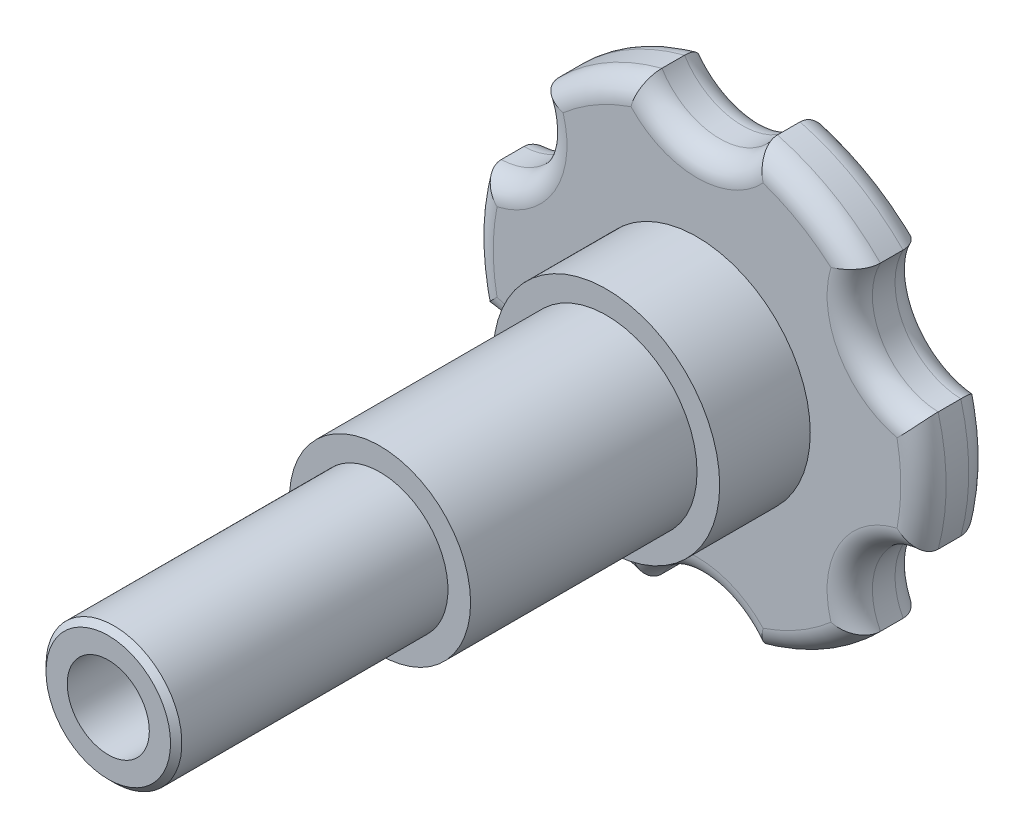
ISO-10303-21;
HEADER;
FILE_DESCRIPTION(('STEP AP214'),'2;1');
FILE_NAME('part.step','',(''),(''),'','','');
FILE_SCHEMA(('AUTOMOTIVE_DESIGN { 1 0 10303 214 1 1 1 1 }'));
ENDSEC;
DATA;
#1=APPLICATION_CONTEXT('core data for automotive mechanical design processes');
#2=APPLICATION_PROTOCOL_DEFINITION('international standard','automotive_design',2000,#1);
#3=PRODUCT_CONTEXT('',#1,'mechanical');
#4=PRODUCT('Part','Part','',(#3));
#5=PRODUCT_RELATED_PRODUCT_CATEGORY('part','',(#4));
#6=PRODUCT_DEFINITION_FORMATION('','',#4);
#7=PRODUCT_DEFINITION_CONTEXT('part definition',#1,'design');
#8=PRODUCT_DEFINITION('design','',#6,#7);
#9=PRODUCT_DEFINITION_SHAPE('','',#8);
#10=(LENGTH_UNIT() NAMED_UNIT(*) SI_UNIT(.MILLI.,.METRE.));
#11=(NAMED_UNIT(*) PLANE_ANGLE_UNIT() SI_UNIT($,.RADIAN.));
#12=(NAMED_UNIT(*) SI_UNIT($,.STERADIAN.) SOLID_ANGLE_UNIT());
#13=UNCERTAINTY_MEASURE_WITH_UNIT(LENGTH_MEASURE(1.E-05),#10,'distance_accuracy_value','');
#14=(GEOMETRIC_REPRESENTATION_CONTEXT(3) GLOBAL_UNCERTAINTY_ASSIGNED_CONTEXT((#13)) GLOBAL_UNIT_ASSIGNED_CONTEXT((#10,
#11,#12)) REPRESENTATION_CONTEXT('',''));
#15=CARTESIAN_POINT('',(0.,0.,0.));
#16=DIRECTION('',(0.,0.,1.));
#17=DIRECTION('',(1.,0.,0.));
#18=AXIS2_PLACEMENT_3D('',#15,#16,#17);
#19=CARTESIAN_POINT('',(0.,0.,53.975));
#20=DIRECTION('',(0.,0.,1.));
#21=DIRECTION('',(1.,0.,0.));
#22=AXIS2_PLACEMENT_3D('',#19,#20,#21);
#23=PLANE('',#22);
#24=CARTESIAN_POINT('',(0.,0.,53.975));
#25=DIRECTION('',(0.,0.,1.));
#26=DIRECTION('',(1.,0.,0.));
#27=AXIS2_PLACEMENT_3D('',#24,#25,#26);
#28=CIRCLE('',#27,12.7);
#29=CARTESIAN_POINT('',(12.7,0.,53.975));
#30=VERTEX_POINT('',#29);
#31=EDGE_CURVE('E643',#30,#30,#28,.T.);
#32=ORIENTED_EDGE('',*,*,#31,.T.);
#33=EDGE_LOOP('',(#32));
#34=FACE_BOUND('',#33,.T.);
#35=CARTESIAN_POINT('',(0.,0.,53.975));
#36=DIRECTION('',(0.,0.,1.));
#37=DIRECTION('',(1.,0.,0.));
#38=AXIS2_PLACEMENT_3D('',#35,#36,#37);
#39=CIRCLE('',#38,9.525);
#40=CARTESIAN_POINT('',(-9.525,0.,53.975));
#41=VERTEX_POINT('',#40);
#42=EDGE_CURVE('E651',#41,#41,#39,.T.);
#43=ORIENTED_EDGE('',*,*,#42,.F.);
#44=EDGE_LOOP('',(#43));
#45=FACE_BOUND('',#44,.T.);
#46=ADVANCED_FACE('F38',(#34,#45),#23,.T.);
#47=CARTESIAN_POINT('',(0.,0.,22.225));
#48=DIRECTION('',(0.,0.,1.));
#49=DIRECTION('',(1.,0.,0.));
#50=AXIS2_PLACEMENT_3D('',#47,#48,#49);
#51=PLANE('',#50);
#52=CARTESIAN_POINT('',(0.,0.,22.225));
#53=DIRECTION('',(0.,0.,1.));
#54=DIRECTION('',(1.,0.,0.));
#55=AXIS2_PLACEMENT_3D('',#52,#53,#54);
#56=CIRCLE('',#55,15.875);
#57=CARTESIAN_POINT('',(15.875,0.,22.225));
#58=VERTEX_POINT('',#57);
#59=EDGE_CURVE('E642',#58,#58,#56,.T.);
#60=ORIENTED_EDGE('',*,*,#59,.T.);
#61=EDGE_LOOP('',(#60));
#62=FACE_BOUND('',#61,.T.);
#63=CARTESIAN_POINT('',(0.,0.,22.225));
#64=DIRECTION('',(0.,0.,1.));
#65=DIRECTION('',(1.,0.,0.));
#66=AXIS2_PLACEMENT_3D('',#63,#64,#65);
#67=CIRCLE('',#66,12.7);
#68=CARTESIAN_POINT('',(12.7,0.,22.225));
#69=VERTEX_POINT('',#68);
#70=EDGE_CURVE('E646',#69,#69,#67,.T.);
#71=ORIENTED_EDGE('',*,*,#70,.F.);
#72=EDGE_LOOP('',(#71));
#73=FACE_BOUND('',#72,.T.);
#74=ADVANCED_FACE('F353',(#62,#73),#51,.T.);
#75=CARTESIAN_POINT('',(0.,0.,9.525));
#76=DIRECTION('',(0.,0.,1.));
#77=DIRECTION('',(1.,0.,0.));
#78=AXIS2_PLACEMENT_3D('',#75,#76,#77);
#79=PLANE('',#78);
#80=CARTESIAN_POINT('',(0.,0.,9.525));
#81=DIRECTION('',(0.,0.,1.));
#82=DIRECTION('',(1.,0.,0.));
#83=AXIS2_PLACEMENT_3D('',#80,#81,#82);
#84=CIRCLE('',#83,28.575);
#85=CARTESIAN_POINT('',(18.7780045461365,21.5387365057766,9.525));
#86=VERTEX_POINT('',#85);
#87=CARTESIAN_POINT('',(9.26409070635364,27.0315972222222,9.525));
#88=VERTEX_POINT('',#87);
#89=EDGE_CURVE('E260',#86,#88,#84,.T.);
#90=ORIENTED_EDGE('',*,*,#89,.T.);
#91=CARTESIAN_POINT('',(0.,35.71875,9.525));
#92=DIRECTION('',(0.,0.,1.));
#93=DIRECTION('',(1.,0.,0.));
#94=AXIS2_PLACEMENT_3D('',#91,#92,#93);
#95=CIRCLE('',#94,12.7);
#96=CARTESIAN_POINT('',(-9.26409070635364,27.0315972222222,9.525));
#97=VERTEX_POINT('',#96);
#98=EDGE_CURVE('E208',#88,#97,#95,.F.);
#99=ORIENTED_EDGE('',*,*,#98,.T.);
#100=CARTESIAN_POINT('',(0.,0.,9.525));
#101=DIRECTION('',(0.,0.,1.));
#102=DIRECTION('',(1.,0.,0.));
#103=AXIS2_PLACEMENT_3D('',#100,#101,#102);
#104=CIRCLE('',#103,28.575);
#105=CARTESIAN_POINT('',(-18.7780045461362,21.5387365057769,9.525));
#106=VERTEX_POINT('',#105);
#107=EDGE_CURVE('E231',#97,#106,#104,.T.);
#108=ORIENTED_EDGE('',*,*,#107,.T.);
#109=CARTESIAN_POINT('',(-30.9333448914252,17.8593750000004,9.525));
#110=DIRECTION('',(0.,0.,1.));
#111=DIRECTION('',(1.,0.,0.));
#112=AXIS2_PLACEMENT_3D('',#109,#110,#111);
#113=CIRCLE('',#112,12.7);
#114=CARTESIAN_POINT('',(-28.0420952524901,5.49286071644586,9.525));
#115=VERTEX_POINT('',#114);
#116=EDGE_CURVE('E242',#106,#115,#113,.F.);
#117=ORIENTED_EDGE('',*,*,#116,.T.);
#118=CARTESIAN_POINT('',(0.,0.,9.525));
#119=DIRECTION('',(0.,0.,1.));
#120=DIRECTION('',(1.,0.,0.));
#121=AXIS2_PLACEMENT_3D('',#118,#119,#120);
#122=CIRCLE('',#121,28.575);
#123=CARTESIAN_POINT('',(-28.0420952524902,-5.49286071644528,9.525));
#124=VERTEX_POINT('',#123);
#125=EDGE_CURVE('E244',#115,#124,#122,.T.);
#126=ORIENTED_EDGE('',*,*,#125,.T.);
#127=CARTESIAN_POINT('',(-30.9333448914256,-17.8593749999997,9.525));
#128=DIRECTION('',(0.,0.,1.));
#129=DIRECTION('',(1.,0.,0.));
#130=AXIS2_PLACEMENT_3D('',#127,#128,#129);
#131=CIRCLE('',#130,12.7);
#132=CARTESIAN_POINT('',(-18.7780045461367,-21.5387365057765,9.525));
#133=VERTEX_POINT('',#132);
#134=EDGE_CURVE('E246',#124,#133,#131,.F.);
#135=ORIENTED_EDGE('',*,*,#134,.T.);
#136=CARTESIAN_POINT('',(0.,0.,9.525));
#137=DIRECTION('',(0.,0.,1.));
#138=DIRECTION('',(1.,0.,0.));
#139=AXIS2_PLACEMENT_3D('',#136,#137,#138);
#140=CIRCLE('',#139,28.575);
#141=CARTESIAN_POINT('',(-9.26409070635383,-27.0315972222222,9.525));
#142=VERTEX_POINT('',#141);
#143=EDGE_CURVE('E248',#133,#142,#140,.T.);
#144=ORIENTED_EDGE('',*,*,#143,.T.);
#145=CARTESIAN_POINT('',(-2.49422842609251E-13,-35.71875,9.525));
#146=DIRECTION('',(0.,0.,1.));
#147=DIRECTION('',(1.,0.,0.));
#148=AXIS2_PLACEMENT_3D('',#145,#146,#147);
#149=CIRCLE('',#148,12.7);
#150=CARTESIAN_POINT('',(9.26409070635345,-27.0315972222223,9.525));
#151=VERTEX_POINT('',#150);
#152=EDGE_CURVE('E250',#142,#151,#149,.F.);
#153=ORIENTED_EDGE('',*,*,#152,.T.);
#154=CARTESIAN_POINT('',(0.,0.,9.525));
#155=DIRECTION('',(0.,0.,1.));
#156=DIRECTION('',(1.,0.,0.));
#157=AXIS2_PLACEMENT_3D('',#154,#155,#156);
#158=CIRCLE('',#157,28.575);
#159=CARTESIAN_POINT('',(18.7780045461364,-21.5387365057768,9.525));
#160=VERTEX_POINT('',#159);
#161=EDGE_CURVE('E252',#151,#160,#158,.T.);
#162=ORIENTED_EDGE('',*,*,#161,.T.);
#163=CARTESIAN_POINT('',(30.9333448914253,-17.8593750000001,9.525));
#164=DIRECTION('',(0.,0.,1.));
#165=DIRECTION('',(1.,0.,0.));
#166=AXIS2_PLACEMENT_3D('',#163,#164,#165);
#167=CIRCLE('',#166,12.7);
#168=CARTESIAN_POINT('',(28.0420952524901,-5.49286071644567,9.525));
#169=VERTEX_POINT('',#168);
#170=EDGE_CURVE('E254',#160,#169,#167,.F.);
#171=ORIENTED_EDGE('',*,*,#170,.T.);
#172=CARTESIAN_POINT('',(0.,0.,9.525));
#173=DIRECTION('',(0.,0.,1.));
#174=DIRECTION('',(1.,0.,0.));
#175=AXIS2_PLACEMENT_3D('',#172,#173,#174);
#176=CIRCLE('',#175,28.575);
#177=CARTESIAN_POINT('',(28.0420952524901,5.49286071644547,9.525));
#178=VERTEX_POINT('',#177);
#179=EDGE_CURVE('E256',#169,#178,#176,.T.);
#180=ORIENTED_EDGE('',*,*,#179,.T.);
#181=CARTESIAN_POINT('',(30.9333448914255,17.8593749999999,9.525));
#182=DIRECTION('',(0.,0.,1.));
#183=DIRECTION('',(1.,0.,0.));
#184=AXIS2_PLACEMENT_3D('',#181,#182,#183);
#185=CIRCLE('',#184,12.7);
#186=EDGE_CURVE('E258',#178,#86,#185,.F.);
#187=ORIENTED_EDGE('',*,*,#186,.T.);
#188=EDGE_LOOP('',(#90,#99,#108,#117,#126,#135,#144,#153,#162,#171,#180,#187));
#189=FACE_BOUND('',#188,.T.);
#190=CARTESIAN_POINT('',(0.,0.,9.525));
#191=DIRECTION('',(0.,0.,1.));
#192=DIRECTION('',(1.,0.,0.));
#193=AXIS2_PLACEMENT_3D('',#190,#191,#192);
#194=CIRCLE('',#193,15.875);
#195=CARTESIAN_POINT('',(15.875,0.,9.525));
#196=VERTEX_POINT('',#195);
#197=EDGE_CURVE('E640',#196,#196,#194,.T.);
#198=ORIENTED_EDGE('',*,*,#197,.F.);
#199=EDGE_LOOP('',(#198));
#200=FACE_BOUND('',#199,.T.);
#201=ADVANCED_FACE('F359',(#189,#200),#79,.T.);
#202=CARTESIAN_POINT('',(0.,0.,9.525));
#203=DIRECTION('',(0.,0.,-1.));
#204=DIRECTION('',(-1.,0.,0.));
#205=AXIS2_PLACEMENT_3D('',#202,#203,#204);
#206=CYLINDRICAL_SURFACE('',#205,31.75);
#207=DIRECTION('',(0.,0.,-1.));
#208=VECTOR('',#207,1.);
#209=CARTESIAN_POINT('',(-8.09584168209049,30.7004861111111,4.7625));
#210=LINE('',#209,#208);
#211=CARTESIAN_POINT('',(-8.09584168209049,30.7004861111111,3.175));
#212=VERTEX_POINT('',#211);
#213=CARTESIAN_POINT('',(-8.09584168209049,30.7004861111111,6.35));
#214=VERTEX_POINT('',#213);
#215=EDGE_CURVE('E229',#212,#214,#210,.F.);
#216=ORIENTED_EDGE('',*,*,#215,.F.);
#217=CARTESIAN_POINT('',(0.,0.,3.175));
#218=DIRECTION('',(0.,0.,1.));
#219=DIRECTION('',(1.,0.,0.));
#220=AXIS2_PLACEMENT_3D('',#217,#218,#219);
#221=CIRCLE('',#220,31.75);
#222=CARTESIAN_POINT('',(-22.539480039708,22.3614476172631,3.175));
#223=VERTEX_POINT('',#222);
#224=EDGE_CURVE('E53',#212,#223,#221,.T.);
#225=ORIENTED_EDGE('',*,*,#224,.T.);
#226=DIRECTION('',(0.,0.,-1.));
#227=VECTOR('',#226,1.);
#228=CARTESIAN_POINT('',(-22.539480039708,22.3614476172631,4.7625));
#229=LINE('',#228,#227);
#230=CARTESIAN_POINT('',(-22.539480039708,22.3614476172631,6.35));
#231=VERTEX_POINT('',#230);
#232=EDGE_CURVE('E687',#231,#223,#229,.T.);
#233=ORIENTED_EDGE('',*,*,#232,.F.);
#234=CARTESIAN_POINT('',(0.,0.,6.35));
#235=DIRECTION('',(0.,0.,1.));
#236=DIRECTION('',(1.,0.,0.));
#237=AXIS2_PLACEMENT_3D('',#234,#235,#236);
#238=CIRCLE('',#237,31.75);
#239=EDGE_CURVE('E284',#231,#214,#238,.F.);
#240=ORIENTED_EDGE('',*,*,#239,.T.);
#241=EDGE_LOOP('',(#216,#225,#233,#240));
#242=FACE_BOUND('',#241,.T.);
#243=ADVANCED_FACE('F40',(#242),#206,.T.);
#244=DIRECTION('',(0.,0.,-1.));
#245=VECTOR('',#244,1.);
#246=CARTESIAN_POINT('',(-30.6353217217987,8.33903849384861,4.7625));
#247=LINE('',#246,#245);
#248=CARTESIAN_POINT('',(-30.6353217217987,8.33903849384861,3.175));
#249=VERTEX_POINT('',#248);
#250=CARTESIAN_POINT('',(-30.6353217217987,8.33903849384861,6.35));
#251=VERTEX_POINT('',#250);
#252=EDGE_CURVE('E680',#249,#251,#247,.F.);
#253=ORIENTED_EDGE('',*,*,#252,.F.);
#254=CARTESIAN_POINT('',(0.,0.,3.175));
#255=DIRECTION('',(0.,0.,1.));
#256=DIRECTION('',(1.,0.,0.));
#257=AXIS2_PLACEMENT_3D('',#254,#255,#256);
#258=CIRCLE('',#257,31.75);
#259=CARTESIAN_POINT('',(-30.6353217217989,-8.33903849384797,3.175));
#260=VERTEX_POINT('',#259);
#261=EDGE_CURVE('E286',#249,#260,#258,.T.);
#262=ORIENTED_EDGE('',*,*,#261,.T.);
#263=DIRECTION('',(0.,0.,-1.));
#264=VECTOR('',#263,1.);
#265=CARTESIAN_POINT('',(-30.6353217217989,-8.33903849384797,4.7625));
#266=LINE('',#265,#264);
#267=CARTESIAN_POINT('',(-30.6353217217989,-8.33903849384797,6.35));
#268=VERTEX_POINT('',#267);
#269=EDGE_CURVE('E678',#268,#260,#266,.T.);
#270=ORIENTED_EDGE('',*,*,#269,.F.);
#271=CARTESIAN_POINT('',(0.,0.,6.35));
#272=DIRECTION('',(0.,0.,1.));
#273=DIRECTION('',(1.,0.,0.));
#274=AXIS2_PLACEMENT_3D('',#271,#272,#273);
#275=CIRCLE('',#274,31.75);
#276=EDGE_CURVE('E279',#268,#251,#275,.F.);
#277=ORIENTED_EDGE('',*,*,#276,.T.);
#278=EDGE_LOOP('',(#253,#262,#270,#277));
#279=FACE_BOUND('',#278,.T.);
#280=ADVANCED_FACE('F630',(#279),#206,.T.);
#281=CARTESIAN_POINT('',(0.,0.,0.));
#282=DIRECTION('',(0.,0.,1.));
#283=DIRECTION('',(1.,0.,0.));
#284=AXIS2_PLACEMENT_3D('',#281,#282,#283);
#285=PLANE('',#284);
#286=CARTESIAN_POINT('',(0.,0.,0.));
#287=DIRECTION('',(0.,0.,1.));
#288=DIRECTION('',(1.,0.,0.));
#289=AXIS2_PLACEMENT_3D('',#286,#287,#288);
#290=CIRCLE('',#289,5.75437);
#291=CARTESIAN_POINT('',(5.75437,0.,0.));
#292=VERTEX_POINT('',#291);
#293=EDGE_CURVE('E654',#292,#292,#290,.T.);
#294=ORIENTED_EDGE('',*,*,#293,.T.);
#295=EDGE_LOOP('',(#294));
#296=FACE_BOUND('',#295,.T.);
#297=CARTESIAN_POINT('',(-30.9333448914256,-17.8593749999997,0.));
#298=DIRECTION('',(0.,0.,1.));
#299=DIRECTION('',(1.,0.,0.));
#300=AXIS2_PLACEMENT_3D('',#297,#298,#299);
#301=CIRCLE('',#300,12.7);
#302=CARTESIAN_POINT('',(-18.7780045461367,-21.5387365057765,0.));
#303=VERTEX_POINT('',#302);
#304=CARTESIAN_POINT('',(-28.0420952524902,-5.49286071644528,0.));
#305=VERTEX_POINT('',#304);
#306=EDGE_CURVE('E309',#303,#305,#301,.T.);
#307=ORIENTED_EDGE('',*,*,#306,.T.);
#308=CARTESIAN_POINT('',(0.,0.,0.));
#309=DIRECTION('',(0.,0.,1.));
#310=DIRECTION('',(1.,0.,0.));
#311=AXIS2_PLACEMENT_3D('',#308,#309,#310);
#312=CIRCLE('',#311,28.575);
#313=CARTESIAN_POINT('',(-28.0420952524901,5.49286071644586,0.));
#314=VERTEX_POINT('',#313);
#315=EDGE_CURVE('E311',#305,#314,#312,.F.);
#316=ORIENTED_EDGE('',*,*,#315,.T.);
#317=CARTESIAN_POINT('',(-30.9333448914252,17.8593750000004,0.));
#318=DIRECTION('',(0.,0.,1.));
#319=DIRECTION('',(1.,0.,0.));
#320=AXIS2_PLACEMENT_3D('',#317,#318,#319);
#321=CIRCLE('',#320,12.7);
#322=CARTESIAN_POINT('',(-18.7780045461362,21.5387365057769,0.));
#323=VERTEX_POINT('',#322);
#324=EDGE_CURVE('E289',#314,#323,#321,.T.);
#325=ORIENTED_EDGE('',*,*,#324,.T.);
#326=CARTESIAN_POINT('',(0.,0.,0.));
#327=DIRECTION('',(0.,0.,1.));
#328=DIRECTION('',(1.,0.,0.));
#329=AXIS2_PLACEMENT_3D('',#326,#327,#328);
#330=CIRCLE('',#329,28.575);
#331=CARTESIAN_POINT('',(-9.26409070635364,27.0315972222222,0.));
#332=VERTEX_POINT('',#331);
#333=EDGE_CURVE('E291',#323,#332,#330,.F.);
#334=ORIENTED_EDGE('',*,*,#333,.T.);
#335=CARTESIAN_POINT('',(0.,35.71875,0.));
#336=DIRECTION('',(0.,0.,1.));
#337=DIRECTION('',(1.,0.,0.));
#338=AXIS2_PLACEMENT_3D('',#335,#336,#337);
#339=CIRCLE('',#338,12.7);
#340=CARTESIAN_POINT('',(9.26409070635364,27.0315972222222,0.));
#341=VERTEX_POINT('',#340);
#342=EDGE_CURVE('E293',#332,#341,#339,.T.);
#343=ORIENTED_EDGE('',*,*,#342,.T.);
#344=CARTESIAN_POINT('',(0.,0.,0.));
#345=DIRECTION('',(0.,0.,1.));
#346=DIRECTION('',(1.,0.,0.));
#347=AXIS2_PLACEMENT_3D('',#344,#345,#346);
#348=CIRCLE('',#347,28.575);
#349=CARTESIAN_POINT('',(18.7780045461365,21.5387365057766,0.));
#350=VERTEX_POINT('',#349);
#351=EDGE_CURVE('E295',#341,#350,#348,.F.);
#352=ORIENTED_EDGE('',*,*,#351,.T.);
#353=CARTESIAN_POINT('',(30.9333448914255,17.8593749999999,0.));
#354=DIRECTION('',(0.,0.,1.));
#355=DIRECTION('',(1.,0.,0.));
#356=AXIS2_PLACEMENT_3D('',#353,#354,#355);
#357=CIRCLE('',#356,12.7);
#358=CARTESIAN_POINT('',(28.0420952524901,5.49286071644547,0.));
#359=VERTEX_POINT('',#358);
#360=EDGE_CURVE('E297',#350,#359,#357,.T.);
#361=ORIENTED_EDGE('',*,*,#360,.T.);
#362=CARTESIAN_POINT('',(0.,0.,0.));
#363=DIRECTION('',(0.,0.,1.));
#364=DIRECTION('',(1.,0.,0.));
#365=AXIS2_PLACEMENT_3D('',#362,#363,#364);
#366=CIRCLE('',#365,28.575);
#367=CARTESIAN_POINT('',(28.0420952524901,-5.49286071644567,0.));
#368=VERTEX_POINT('',#367);
#369=EDGE_CURVE('E299',#359,#368,#366,.F.);
#370=ORIENTED_EDGE('',*,*,#369,.T.);
#371=CARTESIAN_POINT('',(30.9333448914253,-17.8593750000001,0.));
#372=DIRECTION('',(0.,0.,1.));
#373=DIRECTION('',(1.,0.,0.));
#374=AXIS2_PLACEMENT_3D('',#371,#372,#373);
#375=CIRCLE('',#374,12.7);
#376=CARTESIAN_POINT('',(18.7780045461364,-21.5387365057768,0.));
#377=VERTEX_POINT('',#376);
#378=EDGE_CURVE('E301',#368,#377,#375,.T.);
#379=ORIENTED_EDGE('',*,*,#378,.T.);
#380=CARTESIAN_POINT('',(0.,0.,0.));
#381=DIRECTION('',(0.,0.,1.));
#382=DIRECTION('',(1.,0.,0.));
#383=AXIS2_PLACEMENT_3D('',#380,#381,#382);
#384=CIRCLE('',#383,28.575);
#385=CARTESIAN_POINT('',(9.26409070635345,-27.0315972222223,0.));
#386=VERTEX_POINT('',#385);
#387=EDGE_CURVE('E303',#377,#386,#384,.F.);
#388=ORIENTED_EDGE('',*,*,#387,.T.);
#389=CARTESIAN_POINT('',(-2.49422842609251E-13,-35.71875,0.));
#390=DIRECTION('',(0.,0.,1.));
#391=DIRECTION('',(1.,0.,0.));
#392=AXIS2_PLACEMENT_3D('',#389,#390,#391);
#393=CIRCLE('',#392,12.7);
#394=CARTESIAN_POINT('',(-9.26409070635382,-27.0315972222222,0.));
#395=VERTEX_POINT('',#394);
#396=EDGE_CURVE('E305',#386,#395,#393,.T.);
#397=ORIENTED_EDGE('',*,*,#396,.T.);
#398=CARTESIAN_POINT('',(0.,0.,0.));
#399=DIRECTION('',(0.,0.,1.));
#400=DIRECTION('',(1.,0.,0.));
#401=AXIS2_PLACEMENT_3D('',#398,#399,#400);
#402=CIRCLE('',#401,28.575);
#403=EDGE_CURVE('E307',#395,#303,#402,.F.);
#404=ORIENTED_EDGE('',*,*,#403,.T.);
#405=EDGE_LOOP('',(#307,#316,#325,#334,#343,#352,#361,#370,#379,#388,#397,#404));
#406=FACE_BOUND('',#405,.T.);
#407=ADVANCED_FACE('F627',(#296,#406),#285,.F.);
#408=DIRECTION('',(0.,0.,-1.));
#409=VECTOR('',#408,1.);
#410=CARTESIAN_POINT('',(-22.5394800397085,-22.3614476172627,4.7625));
#411=LINE('',#410,#409);
#412=CARTESIAN_POINT('',(-22.5394800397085,-22.3614476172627,3.175));
#413=VERTEX_POINT('',#412);
#414=CARTESIAN_POINT('',(-22.5394800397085,-22.3614476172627,6.35));
#415=VERTEX_POINT('',#414);
#416=EDGE_CURVE('E683',#413,#415,#411,.F.);
#417=ORIENTED_EDGE('',*,*,#416,.F.);
#418=CARTESIAN_POINT('',(0.,0.,3.175));
#419=DIRECTION('',(0.,0.,1.));
#420=DIRECTION('',(1.,0.,0.));
#421=AXIS2_PLACEMENT_3D('',#418,#419,#420);
#422=CIRCLE('',#421,31.75);
#423=CARTESIAN_POINT('',(-8.0958416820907,-30.7004861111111,3.175));
#424=VERTEX_POINT('',#423);
#425=EDGE_CURVE('E316',#413,#424,#422,.T.);
#426=ORIENTED_EDGE('',*,*,#425,.T.);
#427=DIRECTION('',(0.,0.,-1.));
#428=VECTOR('',#427,1.);
#429=CARTESIAN_POINT('',(-8.0958416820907,-30.7004861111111,4.7625));
#430=LINE('',#429,#428);
#431=CARTESIAN_POINT('',(-8.0958416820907,-30.7004861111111,6.35));
#432=VERTEX_POINT('',#431);
#433=EDGE_CURVE('E685',#432,#424,#430,.T.);
#434=ORIENTED_EDGE('',*,*,#433,.F.);
#435=CARTESIAN_POINT('',(0.,0.,6.35));
#436=DIRECTION('',(0.,0.,1.));
#437=DIRECTION('',(1.,0.,0.));
#438=AXIS2_PLACEMENT_3D('',#435,#436,#437);
#439=CIRCLE('',#438,31.75);
#440=EDGE_CURVE('E274',#432,#415,#439,.F.);
#441=ORIENTED_EDGE('',*,*,#440,.T.);
#442=EDGE_LOOP('',(#417,#426,#434,#441));
#443=FACE_BOUND('',#442,.T.);
#444=ADVANCED_FACE('F629',(#443),#206,.T.);
#445=DIRECTION('',(0.,0.,-1.));
#446=VECTOR('',#445,1.);
#447=CARTESIAN_POINT('',(8.09584168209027,-30.7004861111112,4.7625));
#448=LINE('',#447,#446);
#449=CARTESIAN_POINT('',(8.09584168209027,-30.7004861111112,3.175));
#450=VERTEX_POINT('',#449);
#451=CARTESIAN_POINT('',(8.09584168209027,-30.7004861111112,6.35));
#452=VERTEX_POINT('',#451);
#453=EDGE_CURVE('E682',#450,#452,#448,.F.);
#454=ORIENTED_EDGE('',*,*,#453,.F.);
#455=CARTESIAN_POINT('',(0.,0.,3.175));
#456=DIRECTION('',(0.,0.,1.));
#457=DIRECTION('',(1.,0.,0.));
#458=AXIS2_PLACEMENT_3D('',#455,#456,#457);
#459=CIRCLE('',#458,31.75);
#460=CARTESIAN_POINT('',(22.5394800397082,-22.361447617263,3.175));
#461=VERTEX_POINT('',#460);
#462=EDGE_CURVE('E320',#450,#461,#459,.T.);
#463=ORIENTED_EDGE('',*,*,#462,.T.);
#464=DIRECTION('',(0.,0.,-1.));
#465=VECTOR('',#464,1.);
#466=CARTESIAN_POINT('',(22.5394800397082,-22.361447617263,4.7625));
#467=LINE('',#466,#465);
#468=CARTESIAN_POINT('',(22.5394800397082,-22.361447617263,6.35));
#469=VERTEX_POINT('',#468);
#470=EDGE_CURVE('E695',#469,#461,#467,.T.);
#471=ORIENTED_EDGE('',*,*,#470,.F.);
#472=CARTESIAN_POINT('',(0.,0.,6.35));
#473=DIRECTION('',(0.,0.,1.));
#474=DIRECTION('',(1.,0.,0.));
#475=AXIS2_PLACEMENT_3D('',#472,#473,#474);
#476=CIRCLE('',#475,31.75);
#477=EDGE_CURVE('E269',#469,#452,#476,.F.);
#478=ORIENTED_EDGE('',*,*,#477,.T.);
#479=EDGE_LOOP('',(#454,#463,#471,#478));
#480=FACE_BOUND('',#479,.T.);
#481=ADVANCED_FACE('F1007',(#480),#206,.T.);
#482=DIRECTION('',(0.,0.,-1.));
#483=VECTOR('',#482,1.);
#484=CARTESIAN_POINT('',(30.6353217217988,-8.3390384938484,4.7625));
#485=LINE('',#484,#483);
#486=CARTESIAN_POINT('',(30.6353217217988,-8.3390384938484,3.175));
#487=VERTEX_POINT('',#486);
#488=CARTESIAN_POINT('',(30.6353217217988,-8.3390384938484,6.35));
#489=VERTEX_POINT('',#488);
#490=EDGE_CURVE('E693',#487,#489,#485,.F.);
#491=ORIENTED_EDGE('',*,*,#490,.F.);
#492=CARTESIAN_POINT('',(0.,0.,3.175));
#493=DIRECTION('',(0.,0.,1.));
#494=DIRECTION('',(1.,0.,0.));
#495=AXIS2_PLACEMENT_3D('',#492,#493,#494);
#496=CIRCLE('',#495,31.75);
#497=CARTESIAN_POINT('',(30.6353217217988,8.33903849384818,3.175));
#498=VERTEX_POINT('',#497);
#499=EDGE_CURVE('E324',#487,#498,#496,.T.);
#500=ORIENTED_EDGE('',*,*,#499,.T.);
#501=DIRECTION('',(0.,0.,-1.));
#502=VECTOR('',#501,1.);
#503=CARTESIAN_POINT('',(30.6353217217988,8.33903849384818,4.7625));
#504=LINE('',#503,#502);
#505=CARTESIAN_POINT('',(30.6353217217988,8.33903849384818,6.35));
#506=VERTEX_POINT('',#505);
#507=EDGE_CURVE('E237',#506,#498,#504,.T.);
#508=ORIENTED_EDGE('',*,*,#507,.F.);
#509=CARTESIAN_POINT('',(0.,0.,6.35));
#510=DIRECTION('',(0.,0.,1.));
#511=DIRECTION('',(1.,0.,0.));
#512=AXIS2_PLACEMENT_3D('',#509,#510,#511);
#513=CIRCLE('',#512,31.75);
#514=EDGE_CURVE('E264',#506,#489,#513,.F.);
#515=ORIENTED_EDGE('',*,*,#514,.T.);
#516=EDGE_LOOP('',(#491,#500,#508,#515));
#517=FACE_BOUND('',#516,.T.);
#518=ADVANCED_FACE('F1015',(#517),#206,.T.);
#519=DIRECTION('',(0.,0.,-1.));
#520=VECTOR('',#519,1.);
#521=CARTESIAN_POINT('',(22.5394800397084,22.3614476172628,4.7625));
#522=LINE('',#521,#520);
#523=CARTESIAN_POINT('',(22.5394800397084,22.3614476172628,3.175));
#524=VERTEX_POINT('',#523);
#525=CARTESIAN_POINT('',(22.5394800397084,22.3614476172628,6.35));
#526=VERTEX_POINT('',#525);
#527=EDGE_CURVE('E698',#524,#526,#522,.F.);
#528=ORIENTED_EDGE('',*,*,#527,.F.);
#529=CARTESIAN_POINT('',(0.,0.,3.175));
#530=DIRECTION('',(0.,0.,1.));
#531=DIRECTION('',(1.,0.,0.));
#532=AXIS2_PLACEMENT_3D('',#529,#530,#531);
#533=CIRCLE('',#532,31.75);
#534=CARTESIAN_POINT('',(8.09584168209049,30.7004861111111,3.175));
#535=VERTEX_POINT('',#534);
#536=EDGE_CURVE('E235',#524,#535,#533,.T.);
#537=ORIENTED_EDGE('',*,*,#536,.T.);
#538=DIRECTION('',(0.,0.,-1.));
#539=VECTOR('',#538,1.);
#540=CARTESIAN_POINT('',(8.09584168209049,30.7004861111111,4.7625));
#541=LINE('',#540,#539);
#542=CARTESIAN_POINT('',(8.09584168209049,30.7004861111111,6.35));
#543=VERTEX_POINT('',#542);
#544=EDGE_CURVE('E227',#543,#535,#541,.T.);
#545=ORIENTED_EDGE('',*,*,#544,.F.);
#546=CARTESIAN_POINT('',(0.,0.,6.35));
#547=DIRECTION('',(0.,0.,1.));
#548=DIRECTION('',(1.,0.,0.));
#549=AXIS2_PLACEMENT_3D('',#546,#547,#548);
#550=CIRCLE('',#549,31.75);
#551=EDGE_CURVE('E216',#543,#526,#550,.F.);
#552=ORIENTED_EDGE('',*,*,#551,.T.);
#553=EDGE_LOOP('',(#528,#537,#545,#552));
#554=FACE_BOUND('',#553,.T.);
#555=ADVANCED_FACE('F233',(#554),#206,.T.);
#556=CARTESIAN_POINT('',(0.,35.71875,9.525));
#557=DIRECTION('',(0.,0.,-1.));
#558=DIRECTION('',(-1.,0.,0.));
#559=AXIS2_PLACEMENT_3D('',#556,#557,#558);
#560=CYLINDRICAL_SURFACE('',#559,9.525);
#561=ORIENTED_EDGE('',*,*,#544,.T.);
#562=CARTESIAN_POINT('',(0.,35.71875,3.175));
#563=DIRECTION('',(0.,0.,1.));
#564=DIRECTION('',(1.,0.,0.));
#565=AXIS2_PLACEMENT_3D('',#562,#563,#564);
#566=CIRCLE('',#565,9.525);
#567=EDGE_CURVE('E61',#535,#212,#566,.F.);
#568=ORIENTED_EDGE('',*,*,#567,.T.);
#569=ORIENTED_EDGE('',*,*,#215,.T.);
#570=CARTESIAN_POINT('',(0.,35.71875,6.35));
#571=DIRECTION('',(0.,0.,1.));
#572=DIRECTION('',(1.,0.,0.));
#573=AXIS2_PLACEMENT_3D('',#570,#571,#572);
#574=CIRCLE('',#573,9.525);
#575=EDGE_CURVE('E206',#214,#543,#574,.T.);
#576=ORIENTED_EDGE('',*,*,#575,.T.);
#577=EDGE_LOOP('',(#561,#568,#569,#576));
#578=FACE_BOUND('',#577,.T.);
#579=ADVANCED_FACE('F226',(#578),#560,.F.);
#580=CARTESIAN_POINT('',(30.9333448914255,17.8593749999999,9.525));
#581=DIRECTION('',(0.,0.,-1.));
#582=DIRECTION('',(-1.,0.,0.));
#583=AXIS2_PLACEMENT_3D('',#580,#581,#582);
#584=CYLINDRICAL_SURFACE('',#583,9.525);
#585=ORIENTED_EDGE('',*,*,#507,.T.);
#586=CARTESIAN_POINT('',(30.9333448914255,17.8593749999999,3.175));
#587=DIRECTION('',(0.,0.,1.));
#588=DIRECTION('',(1.,0.,0.));
#589=AXIS2_PLACEMENT_3D('',#586,#587,#588);
#590=CIRCLE('',#589,9.525);
#591=EDGE_CURVE('E326',#498,#524,#590,.F.);
#592=ORIENTED_EDGE('',*,*,#591,.T.);
#593=ORIENTED_EDGE('',*,*,#527,.T.);
#594=CARTESIAN_POINT('',(30.9333448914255,17.8593749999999,6.35));
#595=DIRECTION('',(0.,0.,1.));
#596=DIRECTION('',(1.,0.,0.));
#597=AXIS2_PLACEMENT_3D('',#594,#595,#596);
#598=CIRCLE('',#597,9.525);
#599=EDGE_CURVE('E224',#526,#506,#598,.T.);
#600=ORIENTED_EDGE('',*,*,#599,.T.);
#601=EDGE_LOOP('',(#585,#592,#593,#600));
#602=FACE_BOUND('',#601,.T.);
#603=ADVANCED_FACE('F620',(#602),#584,.F.);
#604=CARTESIAN_POINT('',(30.9333448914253,-17.8593750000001,9.525));
#605=DIRECTION('',(0.,0.,-1.));
#606=DIRECTION('',(-1.,0.,0.));
#607=AXIS2_PLACEMENT_3D('',#604,#605,#606);
#608=CYLINDRICAL_SURFACE('',#607,9.525);
#609=ORIENTED_EDGE('',*,*,#470,.T.);
#610=CARTESIAN_POINT('',(30.9333448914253,-17.8593750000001,3.175));
#611=DIRECTION('',(0.,0.,1.));
#612=DIRECTION('',(1.,0.,0.));
#613=AXIS2_PLACEMENT_3D('',#610,#611,#612);
#614=CIRCLE('',#613,9.525);
#615=EDGE_CURVE('E322',#461,#487,#614,.F.);
#616=ORIENTED_EDGE('',*,*,#615,.T.);
#617=ORIENTED_EDGE('',*,*,#490,.T.);
#618=CARTESIAN_POINT('',(30.9333448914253,-17.8593750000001,6.35));
#619=DIRECTION('',(0.,0.,1.));
#620=DIRECTION('',(1.,0.,0.));
#621=AXIS2_PLACEMENT_3D('',#618,#619,#620);
#622=CIRCLE('',#621,9.525);
#623=EDGE_CURVE('E267',#489,#469,#622,.T.);
#624=ORIENTED_EDGE('',*,*,#623,.T.);
#625=EDGE_LOOP('',(#609,#616,#617,#624));
#626=FACE_BOUND('',#625,.T.);
#627=ADVANCED_FACE('F616',(#626),#608,.F.);
#628=CARTESIAN_POINT('',(-2.49422842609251E-13,-35.71875,9.525));
#629=DIRECTION('',(0.,0.,-1.));
#630=DIRECTION('',(-1.,0.,0.));
#631=AXIS2_PLACEMENT_3D('',#628,#629,#630);
#632=CYLINDRICAL_SURFACE('',#631,9.525);
#633=ORIENTED_EDGE('',*,*,#433,.T.);
#634=CARTESIAN_POINT('',(-2.49422842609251E-13,-35.71875,3.175));
#635=DIRECTION('',(0.,0.,1.));
#636=DIRECTION('',(1.,0.,0.));
#637=AXIS2_PLACEMENT_3D('',#634,#635,#636);
#638=CIRCLE('',#637,9.525);
#639=EDGE_CURVE('E318',#424,#450,#638,.F.);
#640=ORIENTED_EDGE('',*,*,#639,.T.);
#641=ORIENTED_EDGE('',*,*,#453,.T.);
#642=CARTESIAN_POINT('',(-2.49422842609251E-13,-35.71875,6.35));
#643=DIRECTION('',(0.,0.,1.));
#644=DIRECTION('',(1.,0.,0.));
#645=AXIS2_PLACEMENT_3D('',#642,#643,#644);
#646=CIRCLE('',#645,9.525);
#647=EDGE_CURVE('E272',#452,#432,#646,.T.);
#648=ORIENTED_EDGE('',*,*,#647,.T.);
#649=EDGE_LOOP('',(#633,#640,#641,#648));
#650=FACE_BOUND('',#649,.T.);
#651=ADVANCED_FACE('F612',(#650),#632,.F.);
#652=CARTESIAN_POINT('',(-30.9333448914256,-17.8593749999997,9.525));
#653=DIRECTION('',(0.,0.,-1.));
#654=DIRECTION('',(-1.,0.,0.));
#655=AXIS2_PLACEMENT_3D('',#652,#653,#654);
#656=CYLINDRICAL_SURFACE('',#655,9.525);
#657=ORIENTED_EDGE('',*,*,#269,.T.);
#658=CARTESIAN_POINT('',(-30.9333448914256,-17.8593749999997,3.175));
#659=DIRECTION('',(0.,0.,1.));
#660=DIRECTION('',(1.,0.,0.));
#661=AXIS2_PLACEMENT_3D('',#658,#659,#660);
#662=CIRCLE('',#661,9.525);
#663=EDGE_CURVE('E314',#260,#413,#662,.F.);
#664=ORIENTED_EDGE('',*,*,#663,.T.);
#665=ORIENTED_EDGE('',*,*,#416,.T.);
#666=CARTESIAN_POINT('',(-30.9333448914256,-17.8593749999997,6.35));
#667=DIRECTION('',(0.,0.,1.));
#668=DIRECTION('',(1.,0.,0.));
#669=AXIS2_PLACEMENT_3D('',#666,#667,#668);
#670=CIRCLE('',#669,9.525);
#671=EDGE_CURVE('E277',#415,#268,#670,.T.);
#672=ORIENTED_EDGE('',*,*,#671,.T.);
#673=EDGE_LOOP('',(#657,#664,#665,#672));
#674=FACE_BOUND('',#673,.T.);
#675=ADVANCED_FACE('F608',(#674),#656,.F.);
#676=CARTESIAN_POINT('',(-30.9333448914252,17.8593750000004,9.525));
#677=DIRECTION('',(0.,0.,-1.));
#678=DIRECTION('',(-1.,0.,0.));
#679=AXIS2_PLACEMENT_3D('',#676,#677,#678);
#680=CYLINDRICAL_SURFACE('',#679,9.525);
#681=ORIENTED_EDGE('',*,*,#232,.T.);
#682=CARTESIAN_POINT('',(-30.9333448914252,17.8593750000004,3.175));
#683=DIRECTION('',(0.,0.,1.));
#684=DIRECTION('',(1.,0.,0.));
#685=AXIS2_PLACEMENT_3D('',#682,#683,#684);
#686=CIRCLE('',#685,9.525);
#687=EDGE_CURVE('E331',#223,#249,#686,.F.);
#688=ORIENTED_EDGE('',*,*,#687,.T.);
#689=ORIENTED_EDGE('',*,*,#252,.T.);
#690=CARTESIAN_POINT('',(-30.9333448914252,17.8593750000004,6.35));
#691=DIRECTION('',(0.,0.,1.));
#692=DIRECTION('',(1.,0.,0.));
#693=AXIS2_PLACEMENT_3D('',#690,#691,#692);
#694=CIRCLE('',#693,9.525);
#695=EDGE_CURVE('E282',#251,#231,#694,.T.);
#696=ORIENTED_EDGE('',*,*,#695,.T.);
#697=EDGE_LOOP('',(#681,#688,#689,#696));
#698=FACE_BOUND('',#697,.T.);
#699=ADVANCED_FACE('F603',(#698),#680,.F.);
#700=CARTESIAN_POINT('',(-2.49422842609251E-13,-35.71875,6.35));
#701=DIRECTION('',(0.,0.,1.));
#702=DIRECTION('',(1.,0.,0.));
#703=AXIS2_PLACEMENT_3D('',#700,#701,#702);
#704=TOROIDAL_SURFACE('',#703,12.7,3.175);
#705=CARTESIAN_POINT('',(8.09584168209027,-30.7004861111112,6.35));
#706=CARTESIAN_POINT('',(8.09583109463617,-30.7005043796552,6.42736928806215));
#707=CARTESIAN_POINT('',(8.09714298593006,-30.6972187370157,6.50472771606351));
#708=CARTESIAN_POINT('',(8.10233144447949,-30.6841802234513,6.65877071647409));
#709=CARTESIAN_POINT('',(8.10620663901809,-30.6744308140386,6.73545562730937));
#710=CARTESIAN_POINT('',(8.11641053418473,-30.6486834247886,6.88712210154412));
#711=CARTESIAN_POINT('',(8.12272420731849,-30.6327237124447,6.96211117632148));
#712=CARTESIAN_POINT('',(8.13765640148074,-30.5948182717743,7.1103099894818));
#713=CARTESIAN_POINT('',(8.14627512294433,-30.572872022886,7.18351957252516));
#714=CARTESIAN_POINT('',(8.17529350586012,-30.4985938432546,7.39946731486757));
#715=CARTESIAN_POINT('',(8.19888502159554,-30.4377491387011,7.53894352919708));
#716=CARTESIAN_POINT('',(8.25287803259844,-30.2963359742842,7.80610574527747));
#717=CARTESIAN_POINT('',(8.28328926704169,-30.2157392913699,7.93377451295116));
#718=CARTESIAN_POINT('',(8.35164772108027,-30.0311920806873,8.18471782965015));
#719=CARTESIAN_POINT('',(8.38999270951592,-29.9259295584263,8.30691535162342));
#720=CARTESIAN_POINT('',(8.47048956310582,-29.6998528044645,8.53434548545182));
#721=CARTESIAN_POINT('',(8.51264192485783,-29.5790365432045,8.63957587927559));
#722=CARTESIAN_POINT('',(8.60710357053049,-29.3013924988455,8.85048293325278));
#723=CARTESIAN_POINT('',(8.65984899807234,-29.1420378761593,8.95263906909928));
#724=CARTESIAN_POINT('',(8.76621939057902,-28.8100412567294,9.13222035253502));
#725=CARTESIAN_POINT('',(8.81984559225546,-28.6373790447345,9.20960691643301));
#726=CARTESIAN_POINT('',(8.94079925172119,-28.2341841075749,9.35708915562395));
#727=CARTESIAN_POINT('',(9.00787039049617,-28.0007212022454,9.4194267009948));
#728=CARTESIAN_POINT('',(9.13800648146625,-27.5259436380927,9.50299787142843));
#729=CARTESIAN_POINT('',(9.20108080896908,-27.2846495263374,9.52433141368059));
#730=CARTESIAN_POINT('',(9.26219173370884,-27.0392323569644,9.52499485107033));
#731=CARTESIAN_POINT('',(9.26314158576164,-27.0354148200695,9.52500000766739));
#732=CARTESIAN_POINT('',(9.26409070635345,-27.0315972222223,9.525));
#733=B_SPLINE_CURVE_WITH_KNOTS('',3,(#705,#706,#707,#708,#709,#710,#711,#712,#713,#714,#715,
#716,#717,#718,#719,#720,#721,#722,#723,#724,#725,#726,#727,#728,#729,#730,#731,#732),
.UNSPECIFIED.,.F.,.F.,(4,2,2,2,2,2,2,2,2,2,2,2,2,4),(0.,0.232009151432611,0.463894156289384,
0.694372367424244,0.924870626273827,1.38460431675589,1.84499877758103,2.34049240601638,
2.83605075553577,3.42330765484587,4.01147492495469,4.76021392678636,5.50712610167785,
5.51892788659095),.UNSPECIFIED.);
#734=EDGE_CURVE('E588',#151,#452,#733,.F.);
#735=ORIENTED_EDGE('',*,*,#734,.F.);
#736=ORIENTED_EDGE('',*,*,#152,.F.);
#737=CARTESIAN_POINT('',(-8.0958416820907,-30.7004861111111,6.35));
#738=CARTESIAN_POINT('',(-8.0958310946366,-30.7005043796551,6.42736928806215));
#739=CARTESIAN_POINT('',(-8.09714298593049,-30.6972187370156,6.50472771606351));
#740=CARTESIAN_POINT('',(-8.10233144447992,-30.6841802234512,6.65877071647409));
#741=CARTESIAN_POINT('',(-8.10620663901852,-30.6744308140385,6.73545562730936));
#742=CARTESIAN_POINT('',(-8.11641053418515,-30.6486834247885,6.88712210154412));
#743=CARTESIAN_POINT('',(-8.12272420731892,-30.6327237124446,6.96211117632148));
#744=CARTESIAN_POINT('',(-8.13765640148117,-30.5948182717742,7.1103099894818));
#745=CARTESIAN_POINT('',(-8.14627512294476,-30.5728720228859,7.18351957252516));
#746=CARTESIAN_POINT('',(-8.17529350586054,-30.4985938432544,7.39946731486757));
#747=CARTESIAN_POINT('',(-8.19888502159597,-30.437749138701,7.53894352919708));
#748=CARTESIAN_POINT('',(-8.25287803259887,-30.2963359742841,7.80610574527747));
#749=CARTESIAN_POINT('',(-8.28328926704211,-30.2157392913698,7.93377451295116));
#750=CARTESIAN_POINT('',(-8.35164772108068,-30.0311920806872,8.18471782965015));
#751=CARTESIAN_POINT('',(-8.38999270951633,-29.9259295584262,8.30691535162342));
#752=CARTESIAN_POINT('',(-8.47048956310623,-29.6998528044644,8.53434548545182));
#753=CARTESIAN_POINT('',(-8.51264192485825,-29.5790365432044,8.63957587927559));
#754=CARTESIAN_POINT('',(-8.6071035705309,-29.3013924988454,8.85048293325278));
#755=CARTESIAN_POINT('',(-8.65984899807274,-29.1420378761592,8.95263906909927));
#756=CARTESIAN_POINT('',(-8.76621939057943,-28.8100412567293,9.13222035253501));
#757=CARTESIAN_POINT('',(-8.81984559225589,-28.6373790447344,9.20960691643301));
#758=CARTESIAN_POINT('',(-8.94079925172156,-28.2341841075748,9.35708915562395));
#759=CARTESIAN_POINT('',(-9.00787039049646,-28.0007212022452,9.4194267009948));
#760=CARTESIAN_POINT('',(-9.13800648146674,-27.5259436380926,9.50299787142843));
#761=CARTESIAN_POINT('',(-9.20108080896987,-27.2846495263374,9.52433141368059));
#762=CARTESIAN_POINT('',(-9.26219173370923,-27.0392323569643,9.52499485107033));
#763=CARTESIAN_POINT('',(-9.26314158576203,-27.0354148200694,9.52500000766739));
#764=CARTESIAN_POINT('',(-9.26409070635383,-27.0315972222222,9.525));
#765=B_SPLINE_CURVE_WITH_KNOTS('',3,(#737,#738,#739,#740,#741,#742,#743,#744,#745,#746,#747,
#748,#749,#750,#751,#752,#753,#754,#755,#756,#757,#758,#759,#760,#761,#762,#763,#764),
.UNSPECIFIED.,.F.,.F.,(4,2,2,2,2,2,2,2,2,2,2,2,2,4),(0.,0.23200915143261,0.463894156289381,
0.694372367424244,0.924870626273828,1.38460431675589,1.84499877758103,2.34049240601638,
2.83605075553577,3.42330765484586,4.01147492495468,4.76021392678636,5.50712610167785,
5.51892788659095),.UNSPECIFIED.);
#766=EDGE_CURVE('E594',#432,#142,#765,.T.);
#767=ORIENTED_EDGE('',*,*,#766,.F.);
#768=ORIENTED_EDGE('',*,*,#647,.F.);
#769=EDGE_LOOP('',(#735,#736,#767,#768));
#770=FACE_BOUND('',#769,.T.);
#771=ADVANCED_FACE('F599',(#770),#704,.T.);
#772=CARTESIAN_POINT('',(0.,0.,6.35));
#773=DIRECTION('',(0.,0.,1.));
#774=DIRECTION('',(1.,0.,0.));
#775=AXIS2_PLACEMENT_3D('',#772,#773,#774);
#776=TOROIDAL_SURFACE('',#775,28.575,3.175);
#777=ORIENTED_EDGE('',*,*,#766,.T.);
#778=ORIENTED_EDGE('',*,*,#143,.F.);
#779=CARTESIAN_POINT('',(-22.5394800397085,-22.3614476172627,6.35));
#780=CARTESIAN_POINT('',(-22.5395011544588,-22.3614475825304,6.42736928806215));
#781=CARTESIAN_POINT('',(-22.5359997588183,-22.3609408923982,6.50472771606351));
#782=CARTESIAN_POINT('',(-22.5221138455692,-22.3589149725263,6.65877071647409));
#783=CARTESIAN_POINT('',(-22.5117330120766,-22.357396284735,6.73545562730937));
#784=CARTESIAN_POINT('',(-22.4843331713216,-22.3533594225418,6.88712210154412));
#785=CARTESIAN_POINT('',(-22.4673548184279,-22.3508473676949,6.96211117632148));
#786=CARTESIAN_POINT('',(-22.4270616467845,-22.3448263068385,7.1103099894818));
#787=CARTESIAN_POINT('',(-22.4037462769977,-22.3413172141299,7.18351957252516));
#788=CARTESIAN_POINT('',(-22.3249102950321,-22.329308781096,7.39946731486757));
#789=CARTESIAN_POINT('',(-22.2604214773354,-22.31931728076,7.53894352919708));
#790=CARTESIAN_POINT('',(-22.1109575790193,-22.2953700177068,7.80610574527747));
#791=CARTESIAN_POINT('',(-22.0259531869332,-22.281408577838,7.93377451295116));
#792=CARTESIAN_POINT('',(-21.8319513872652,-22.2483351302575,8.18471782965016));
#793=CARTESIAN_POINT('',(-21.7216188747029,-22.2289116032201,8.30691535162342));
#794=CARTESIAN_POINT('',(-21.4855822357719,-22.1855855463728,8.53434548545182));
#795=CARTESIAN_POINT('',(-21.3598761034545,-22.1616824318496,8.63957587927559));
#796=CARTESIAN_POINT('',(-21.0721984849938,-22.1046665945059,8.85048293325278));
#797=CARTESIAN_POINT('',(-20.9078206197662,-22.0706681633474,8.95263906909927));
#798=CARTESIAN_POINT('',(-20.567117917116,-21.9967893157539,9.13222035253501));
#799=CARTESIAN_POINT('',(-20.3907749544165,-21.9568998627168,9.20960691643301));
#800=CARTESIAN_POINT('',(-19.9811210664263,-21.8600513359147,9.35708915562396));
#801=CARTESIAN_POINT('',(-19.7454006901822,-21.8014051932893,9.41942670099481));
#802=CARTESIAN_POINT('',(-19.2691632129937,-21.6767175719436,9.50299787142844));
#803=CARTESIAN_POINT('',(-19.028659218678,-21.6106944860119,9.52433141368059));
#804=CARTESIAN_POINT('',(-18.785566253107,-21.5409095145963,9.52499485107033));
#805=CARTESIAN_POINT('',(-18.7817852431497,-21.5398233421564,9.52500000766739));
#806=CARTESIAN_POINT('',(-18.7780045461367,-21.5387365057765,9.525));
#807=B_SPLINE_CURVE_WITH_KNOTS('',3,(#779,#780,#781,#782,#783,#784,#785,#786,#787,#788,#789,
#790,#791,#792,#793,#794,#795,#796,#797,#798,#799,#800,#801,#802,#803,#804,#805,#806),
.UNSPECIFIED.,.F.,.F.,(4,2,2,2,2,2,2,2,2,2,2,2,2,4),(0.,0.232009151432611,0.463894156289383,
0.694372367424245,0.924870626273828,1.38460431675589,1.84499877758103,2.34049240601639,
2.83605075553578,3.42330765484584,4.01147492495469,4.76021392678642,5.50712610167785,
5.51892788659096),.UNSPECIFIED.);
#808=EDGE_CURVE('E574',#415,#133,#807,.T.);
#809=ORIENTED_EDGE('',*,*,#808,.F.);
#810=ORIENTED_EDGE('',*,*,#440,.F.);
#811=EDGE_LOOP('',(#777,#778,#809,#810));
#812=FACE_BOUND('',#811,.T.);
#813=ADVANCED_FACE('F583',(#812),#776,.T.);
#814=CARTESIAN_POINT('',(0.,0.,6.35));
#815=DIRECTION('',(0.,0.,1.));
#816=DIRECTION('',(1.,0.,0.));
#817=AXIS2_PLACEMENT_3D('',#814,#815,#816);
#818=TOROIDAL_SURFACE('',#817,28.575,3.175);
#819=ORIENTED_EDGE('',*,*,#734,.T.);
#820=ORIENTED_EDGE('',*,*,#477,.F.);
#821=CARTESIAN_POINT('',(22.5394800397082,-22.361447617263,6.35));
#822=CARTESIAN_POINT('',(22.5395011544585,-22.3614475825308,6.42736928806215));
#823=CARTESIAN_POINT('',(22.535999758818,-22.3609408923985,6.50472771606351));
#824=CARTESIAN_POINT('',(22.5221138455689,-22.3589149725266,6.65877071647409));
#825=CARTESIAN_POINT('',(22.5117330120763,-22.3573962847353,6.73545562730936));
#826=CARTESIAN_POINT('',(22.4843331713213,-22.3533594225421,6.88712210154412));
#827=CARTESIAN_POINT('',(22.4673548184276,-22.3508473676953,6.96211117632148));
#828=CARTESIAN_POINT('',(22.4270616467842,-22.3448263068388,7.1103099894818));
#829=CARTESIAN_POINT('',(22.4037462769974,-22.3413172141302,7.18351957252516));
#830=CARTESIAN_POINT('',(22.3249102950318,-22.3293087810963,7.39946731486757));
#831=CARTESIAN_POINT('',(22.2604214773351,-22.3193172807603,7.53894352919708));
#832=CARTESIAN_POINT('',(22.110957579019,-22.2953700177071,7.80610574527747));
#833=CARTESIAN_POINT('',(22.0259531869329,-22.2814085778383,7.93377451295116));
#834=CARTESIAN_POINT('',(21.8319513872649,-22.2483351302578,8.18471782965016));
#835=CARTESIAN_POINT('',(21.7216188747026,-22.2289116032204,8.30691535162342));
#836=CARTESIAN_POINT('',(21.4855822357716,-22.1855855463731,8.53434548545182));
#837=CARTESIAN_POINT('',(21.3598761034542,-22.1616824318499,8.63957587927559));
#838=CARTESIAN_POINT('',(21.0721984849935,-22.1046665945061,8.85048293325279));
#839=CARTESIAN_POINT('',(20.9078206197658,-22.0706681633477,8.95263906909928));
#840=CARTESIAN_POINT('',(20.5671179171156,-21.9967893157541,9.13222035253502));
#841=CARTESIAN_POINT('',(20.3907749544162,-21.9568998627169,9.20960691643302));
#842=CARTESIAN_POINT('',(19.9811210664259,-21.8600513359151,9.35708915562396));
#843=CARTESIAN_POINT('',(19.7454006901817,-21.8014051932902,9.4194267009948));
#844=CARTESIAN_POINT('',(19.2691632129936,-21.6767175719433,9.50299787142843));
#845=CARTESIAN_POINT('',(19.0286592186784,-21.6106944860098,9.52433141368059));
#846=CARTESIAN_POINT('',(18.7855662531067,-21.5409095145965,9.52499485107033));
#847=CARTESIAN_POINT('',(18.7817852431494,-21.5398233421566,9.52500000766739));
#848=CARTESIAN_POINT('',(18.7780045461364,-21.5387365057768,9.525));
#849=B_SPLINE_CURVE_WITH_KNOTS('',3,(#821,#822,#823,#824,#825,#826,#827,#828,#829,#830,#831,
#832,#833,#834,#835,#836,#837,#838,#839,#840,#841,#842,#843,#844,#845,#846,#847,#848),
.UNSPECIFIED.,.F.,.F.,(4,2,2,2,2,2,2,2,2,2,2,2,2,4),(0.,0.23200915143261,0.463894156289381,
0.694372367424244,0.924870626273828,1.38460431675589,1.84499877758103,2.34049240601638,
2.83605075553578,3.42330765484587,4.01147492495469,4.76021392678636,5.50712610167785,
5.51892788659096),.UNSPECIFIED.);
#850=EDGE_CURVE('E568',#160,#469,#849,.F.);
#851=ORIENTED_EDGE('',*,*,#850,.F.);
#852=ORIENTED_EDGE('',*,*,#161,.F.);
#853=EDGE_LOOP('',(#819,#820,#851,#852));
#854=FACE_BOUND('',#853,.T.);
#855=ADVANCED_FACE('F580',(#854),#818,.T.);
#856=CARTESIAN_POINT('',(-30.9333448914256,-17.8593749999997,6.35));
#857=DIRECTION('',(0.,0.,1.));
#858=DIRECTION('',(1.,0.,0.));
#859=AXIS2_PLACEMENT_3D('',#856,#857,#858);
#860=TOROIDAL_SURFACE('',#859,12.7,3.175);
#861=ORIENTED_EDGE('',*,*,#808,.T.);
#862=ORIENTED_EDGE('',*,*,#134,.F.);
#863=CARTESIAN_POINT('',(-30.6353217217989,-8.33903849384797,6.35));
#864=CARTESIAN_POINT('',(-30.635332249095,-8.33905679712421,6.42736928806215));
#865=CARTESIAN_POINT('',(-30.6331427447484,-8.33627784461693,6.50472771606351));
#866=CARTESIAN_POINT('',(-30.6244452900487,-8.32526525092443,6.65877071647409));
#867=CARTESIAN_POINT('',(-30.6179396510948,-8.31703452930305,6.73545562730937));
#868=CARTESIAN_POINT('',(-30.6007437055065,-8.29532400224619,6.88712210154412));
#869=CARTESIAN_POINT('',(-30.5900790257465,-8.28187634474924,6.96211117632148));
#870=CARTESIAN_POINT('',(-30.5647180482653,-8.24999196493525,7.1103099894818));
#871=CARTESIAN_POINT('',(-30.5500213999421,-8.23155480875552,7.18351957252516));
#872=CARTESIAN_POINT('',(-30.5002038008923,-8.16928506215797,7.39946731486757));
#873=CARTESIAN_POINT('',(-30.459306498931,-8.11843185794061,7.53894352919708));
#874=CARTESIAN_POINT('',(-30.3638356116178,-8.0009659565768,7.80610574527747));
#875=CARTESIAN_POINT('',(-30.3092424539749,-7.93433071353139,7.93377451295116));
#876=CARTESIAN_POINT('',(-30.1835991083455,-7.78285695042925,8.18471782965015));
#877=CARTESIAN_POINT('',(-30.1116115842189,-7.69701795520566,8.30691535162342));
#878=CARTESIAN_POINT('',(-29.9560717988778,-7.51426725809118,8.53434548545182));
#879=CARTESIAN_POINT('',(-29.8725180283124,-7.41735411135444,8.63957587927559));
#880=CARTESIAN_POINT('',(-29.6793020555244,-7.19672590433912,8.85048293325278));
#881=CARTESIAN_POINT('',(-29.5676696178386,-7.0713697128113,8.95263906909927));
#882=CARTESIAN_POINT('',(-29.333337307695,-6.81325194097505,9.13222035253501));
#883=CARTESIAN_POINT('',(-29.210620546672,-6.68047918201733,9.20960691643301));
#884=CARTESIAN_POINT('',(-28.9219203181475,-6.37413277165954,9.35708915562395));
#885=CARTESIAN_POINT('',(-28.7532710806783,-6.19931600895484,9.4194267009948));
#886=CARTESIAN_POINT('',(-28.4071696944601,-5.84922606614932,9.50299787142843));
#887=CARTESIAN_POINT('',(-28.2297400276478,-5.67395504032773,9.52433141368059));
#888=CARTESIAN_POINT('',(-28.0477579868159,-5.49832284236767,9.52499485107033));
#889=CARTESIAN_POINT('',(-28.0449268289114,-5.49559147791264,9.52500000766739));
#890=CARTESIAN_POINT('',(-28.0420952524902,-5.49286071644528,9.525));
#891=B_SPLINE_CURVE_WITH_KNOTS('',3,(#863,#864,#865,#866,#867,#868,#869,#870,#871,#872,#873,
#874,#875,#876,#877,#878,#879,#880,#881,#882,#883,#884,#885,#886,#887,#888,#889,#890),
.UNSPECIFIED.,.F.,.F.,(4,2,2,2,2,2,2,2,2,2,2,2,2,4),(0.,0.232009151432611,0.463894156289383,
0.694372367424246,0.924870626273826,1.38460431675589,1.84499877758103,2.34049240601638,
2.83605075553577,3.42330765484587,4.01147492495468,4.76021392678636,5.50712610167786,
5.51892788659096),.UNSPECIFIED.);
#892=EDGE_CURVE('E554',#268,#124,#891,.T.);
#893=ORIENTED_EDGE('',*,*,#892,.F.);
#894=ORIENTED_EDGE('',*,*,#671,.F.);
#895=EDGE_LOOP('',(#861,#862,#893,#894));
#896=FACE_BOUND('',#895,.T.);
#897=ADVANCED_FACE('F563',(#896),#860,.T.);
#898=CARTESIAN_POINT('',(30.9333448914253,-17.8593750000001,6.35));
#899=DIRECTION('',(0.,0.,1.));
#900=DIRECTION('',(1.,0.,0.));
#901=AXIS2_PLACEMENT_3D('',#898,#899,#900);
#902=TOROIDAL_SURFACE('',#901,12.7,3.175);
#903=ORIENTED_EDGE('',*,*,#850,.T.);
#904=ORIENTED_EDGE('',*,*,#623,.F.);
#905=CARTESIAN_POINT('',(30.6353217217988,-8.3390384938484,6.35));
#906=CARTESIAN_POINT('',(30.6353322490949,-8.33905679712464,6.42736928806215));
#907=CARTESIAN_POINT('',(30.6331427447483,-8.33627784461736,6.50472771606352));
#908=CARTESIAN_POINT('',(30.6244452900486,-8.32526525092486,6.65877071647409));
#909=CARTESIAN_POINT('',(30.6179396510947,-8.31703452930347,6.73545562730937));
#910=CARTESIAN_POINT('',(30.6007437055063,-8.29532400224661,6.88712210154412));
#911=CARTESIAN_POINT('',(30.5900790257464,-8.28187634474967,6.96211117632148));
#912=CARTESIAN_POINT('',(30.5647180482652,-8.24999196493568,7.1103099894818));
#913=CARTESIAN_POINT('',(30.550021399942,-8.23155480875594,7.18351957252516));
#914=CARTESIAN_POINT('',(30.5002038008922,-8.1692850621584,7.39946731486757));
#915=CARTESIAN_POINT('',(30.4593064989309,-8.11843185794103,7.53894352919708));
#916=CARTESIAN_POINT('',(30.3638356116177,-8.00096595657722,7.80610574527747));
#917=CARTESIAN_POINT('',(30.3092424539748,-7.93433071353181,7.93377451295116));
#918=CARTESIAN_POINT('',(30.1835991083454,-7.78285695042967,8.18471782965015));
#919=CARTESIAN_POINT('',(30.1116115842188,-7.69701795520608,8.30691535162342));
#920=CARTESIAN_POINT('',(29.9560717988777,-7.51426725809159,8.53434548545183));
#921=CARTESIAN_POINT('',(29.8725180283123,-7.41735411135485,8.6395758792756));
#922=CARTESIAN_POINT('',(29.6793020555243,-7.19672590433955,8.85048293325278));
#923=CARTESIAN_POINT('',(29.5676696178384,-7.07136971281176,8.95263906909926));
#924=CARTESIAN_POINT('',(29.333337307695,-6.81325194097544,9.13222035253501));
#925=CARTESIAN_POINT('',(29.210620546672,-6.68047918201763,9.20960691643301));
#926=CARTESIAN_POINT('',(28.9219203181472,-6.37413277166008,9.35708915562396));
#927=CARTESIAN_POINT('',(28.7532710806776,-6.19931600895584,9.41942670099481));
#928=CARTESIAN_POINT('',(28.4071696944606,-5.84922606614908,9.50299787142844));
#929=CARTESIAN_POINT('',(28.2297400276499,-5.6739550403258,9.52433141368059));
#930=CARTESIAN_POINT('',(28.0477579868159,-5.49832284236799,9.52499485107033));
#931=CARTESIAN_POINT('',(28.0449268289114,-5.495591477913,9.52500000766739));
#932=CARTESIAN_POINT('',(28.0420952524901,-5.49286071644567,9.525));
#933=B_SPLINE_CURVE_WITH_KNOTS('',3,(#905,#906,#907,#908,#909,#910,#911,#912,#913,#914,#915,
#916,#917,#918,#919,#920,#921,#922,#923,#924,#925,#926,#927,#928,#929,#930,#931,#932),
.UNSPECIFIED.,.F.,.F.,(4,2,2,2,2,2,2,2,2,2,2,2,2,4),(0.,0.232009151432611,0.463894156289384,
0.694372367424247,0.924870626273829,1.38460431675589,1.84499877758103,2.34049240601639,
2.83605075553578,3.42330765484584,4.01147492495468,4.76021392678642,5.50712610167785,
5.51892788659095),.UNSPECIFIED.);
#934=EDGE_CURVE('E548',#169,#489,#933,.F.);
#935=ORIENTED_EDGE('',*,*,#934,.F.);
#936=ORIENTED_EDGE('',*,*,#170,.F.);
#937=EDGE_LOOP('',(#903,#904,#935,#936));
#938=FACE_BOUND('',#937,.T.);
#939=ADVANCED_FACE('F560',(#938),#902,.T.);
#940=CARTESIAN_POINT('',(0.,0.,6.35));
#941=DIRECTION('',(0.,0.,1.));
#942=DIRECTION('',(1.,0.,0.));
#943=AXIS2_PLACEMENT_3D('',#940,#941,#942);
#944=TOROIDAL_SURFACE('',#943,28.575,3.175);
#945=ORIENTED_EDGE('',*,*,#892,.T.);
#946=ORIENTED_EDGE('',*,*,#125,.F.);
#947=CARTESIAN_POINT('',(-30.6353217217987,8.33903849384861,6.35));
#948=CARTESIAN_POINT('',(-30.6353322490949,8.33905679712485,6.42736928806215));
#949=CARTESIAN_POINT('',(-30.6331427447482,8.33627784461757,6.50472771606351));
#950=CARTESIAN_POINT('',(-30.6244452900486,8.32526525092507,6.65877071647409));
#951=CARTESIAN_POINT('',(-30.6179396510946,8.31703452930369,6.73545562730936));
#952=CARTESIAN_POINT('',(-30.6007437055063,8.29532400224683,6.88712210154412));
#953=CARTESIAN_POINT('',(-30.5900790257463,8.28187634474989,6.96211117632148));
#954=CARTESIAN_POINT('',(-30.5647180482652,8.2499919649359,7.1103099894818));
#955=CARTESIAN_POINT('',(-30.5500213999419,8.23155480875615,7.18351957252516));
#956=CARTESIAN_POINT('',(-30.5002038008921,8.16928506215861,7.39946731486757));
#957=CARTESIAN_POINT('',(-30.4593064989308,8.11843185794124,7.53894352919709));
#958=CARTESIAN_POINT('',(-30.3638356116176,8.00096595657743,7.80610574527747));
#959=CARTESIAN_POINT('',(-30.3092424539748,7.93433071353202,7.93377451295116));
#960=CARTESIAN_POINT('',(-30.1835991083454,7.78285695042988,8.18471782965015));
#961=CARTESIAN_POINT('',(-30.1116115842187,7.69701795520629,8.30691535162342));
#962=CARTESIAN_POINT('',(-29.9560717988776,7.51426725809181,8.53434548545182));
#963=CARTESIAN_POINT('',(-29.8725180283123,7.41735411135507,8.63957587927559));
#964=CARTESIAN_POINT('',(-29.6793020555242,7.19672590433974,8.85048293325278));
#965=CARTESIAN_POINT('',(-29.5676696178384,7.07136971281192,8.95263906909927));
#966=CARTESIAN_POINT('',(-29.3333373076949,6.81325194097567,9.13222035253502));
#967=CARTESIAN_POINT('',(-29.2106205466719,6.68047918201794,9.20960691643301));
#968=CARTESIAN_POINT('',(-28.9219203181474,6.37413277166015,9.35708915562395));
#969=CARTESIAN_POINT('',(-28.7532710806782,6.19931600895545,9.4194267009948));
#970=CARTESIAN_POINT('',(-28.40716969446,5.84922606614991,9.50299787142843));
#971=CARTESIAN_POINT('',(-28.2297400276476,5.67395504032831,9.52433141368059));
#972=CARTESIAN_POINT('',(-28.0477579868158,5.49832284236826,9.52499485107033));
#973=CARTESIAN_POINT('',(-28.0449268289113,5.49559147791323,9.52500000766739));
#974=CARTESIAN_POINT('',(-28.0420952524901,5.49286071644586,9.525));
#975=B_SPLINE_CURVE_WITH_KNOTS('',3,(#947,#948,#949,#950,#951,#952,#953,#954,#955,#956,#957,
#958,#959,#960,#961,#962,#963,#964,#965,#966,#967,#968,#969,#970,#971,#972,#973,#974),
.UNSPECIFIED.,.F.,.F.,(4,2,2,2,2,2,2,2,2,2,2,2,2,4),(0.,0.232009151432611,0.463894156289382,
0.694372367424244,0.924870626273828,1.38460431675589,1.84499877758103,2.34049240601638,
2.83605075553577,3.42330765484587,4.01147492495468,4.76021392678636,5.50712610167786,
5.51892788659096),.UNSPECIFIED.);
#976=EDGE_CURVE('E534',#251,#115,#975,.T.);
#977=ORIENTED_EDGE('',*,*,#976,.F.);
#978=ORIENTED_EDGE('',*,*,#276,.F.);
#979=EDGE_LOOP('',(#945,#946,#977,#978));
#980=FACE_BOUND('',#979,.T.);
#981=ADVANCED_FACE('F543',(#980),#944,.T.);
#982=CARTESIAN_POINT('',(0.,0.,6.35));
#983=DIRECTION('',(0.,0.,1.));
#984=DIRECTION('',(1.,0.,0.));
#985=AXIS2_PLACEMENT_3D('',#982,#983,#984);
#986=TOROIDAL_SURFACE('',#985,28.575,3.175);
#987=ORIENTED_EDGE('',*,*,#934,.T.);
#988=ORIENTED_EDGE('',*,*,#514,.F.);
#989=CARTESIAN_POINT('',(30.6353217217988,8.33903849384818,6.35));
#990=CARTESIAN_POINT('',(30.635332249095,8.33905679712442,6.42736928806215));
#991=CARTESIAN_POINT('',(30.6331427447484,8.33627784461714,6.50472771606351));
#992=CARTESIAN_POINT('',(30.6244452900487,8.32526525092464,6.65877071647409));
#993=CARTESIAN_POINT('',(30.6179396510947,8.31703452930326,6.73545562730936));
#994=CARTESIAN_POINT('',(30.6007437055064,8.2953240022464,6.88712210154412));
#995=CARTESIAN_POINT('',(30.5900790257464,8.28187634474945,6.96211117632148));
#996=CARTESIAN_POINT('',(30.5647180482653,8.24999196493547,7.1103099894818));
#997=CARTESIAN_POINT('',(30.5500213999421,8.23155480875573,7.18351957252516));
#998=CARTESIAN_POINT('',(30.5002038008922,8.16928506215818,7.39946731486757));
#999=CARTESIAN_POINT('',(30.459306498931,8.11843185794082,7.53894352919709));
#1000=CARTESIAN_POINT('',(30.3638356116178,8.00096595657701,7.80610574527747));
#1001=CARTESIAN_POINT('',(30.3092424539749,7.9343307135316,7.93377451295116));
#1002=CARTESIAN_POINT('',(30.1835991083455,7.78285695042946,8.18471782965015));
#1003=CARTESIAN_POINT('',(30.1116115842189,7.69701795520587,8.30691535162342));
#1004=CARTESIAN_POINT('',(29.9560717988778,7.51426725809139,8.53434548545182));
#1005=CARTESIAN_POINT('',(29.8725180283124,7.41735411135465,8.63957587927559));
#1006=CARTESIAN_POINT('',(29.6793020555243,7.19672590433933,8.85048293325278));
#1007=CARTESIAN_POINT('',(29.5676696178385,7.07136971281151,8.95263906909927));
#1008=CARTESIAN_POINT('',(29.333337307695,6.81325194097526,9.13222035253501));
#1009=CARTESIAN_POINT('',(29.210620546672,6.68047918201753,9.20960691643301));
#1010=CARTESIAN_POINT('',(28.9219203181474,6.37413277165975,9.35708915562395));
#1011=CARTESIAN_POINT('',(28.7532710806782,6.19931600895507,9.4194267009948));
#1012=CARTESIAN_POINT('',(28.4071696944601,5.8492260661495,9.50299787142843));
#1013=CARTESIAN_POINT('',(28.2297400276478,5.67395504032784,9.52433141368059));
#1014=CARTESIAN_POINT('',(28.0477579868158,5.49832284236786,9.52499485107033));
#1015=CARTESIAN_POINT('',(28.0449268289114,5.49559147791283,9.52500000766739));
#1016=CARTESIAN_POINT('',(28.0420952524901,5.49286071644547,9.525));
#1017=B_SPLINE_CURVE_WITH_KNOTS('',3,(#989,#990,#991,#992,#993,#994,#995,#996,#997,#998,#999,
#1000,#1001,#1002,#1003,#1004,#1005,#1006,#1007,#1008,#1009,#1010,#1011,#1012,#1013,#1014,#1015,
#1016),.UNSPECIFIED.,.F.,.F.,(4,2,2,2,2,2,2,2,2,2,2,2,2,4),(0.,0.232009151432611,
0.463894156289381,0.694372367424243,0.924870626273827,1.38460431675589,1.84499877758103,
2.34049240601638,2.83605075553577,3.42330765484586,4.01147492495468,4.76021392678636,
5.50712610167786,5.51892788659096),.UNSPECIFIED.);
#1018=EDGE_CURVE('E528',#178,#506,#1017,.F.);
#1019=ORIENTED_EDGE('',*,*,#1018,.F.);
#1020=ORIENTED_EDGE('',*,*,#179,.F.);
#1021=EDGE_LOOP('',(#987,#988,#1019,#1020));
#1022=FACE_BOUND('',#1021,.T.);
#1023=ADVANCED_FACE('F540',(#1022),#986,.T.);
#1024=CARTESIAN_POINT('',(-30.9333448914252,17.8593750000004,6.35));
#1025=DIRECTION('',(0.,0.,1.));
#1026=DIRECTION('',(1.,0.,0.));
#1027=AXIS2_PLACEMENT_3D('',#1024,#1025,#1026);
#1028=TOROIDAL_SURFACE('',#1027,12.7,3.175);
#1029=ORIENTED_EDGE('',*,*,#976,.T.);
#1030=ORIENTED_EDGE('',*,*,#116,.F.);
#1031=CARTESIAN_POINT('',(-22.539480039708,22.3614476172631,6.35));
#1032=CARTESIAN_POINT('',(-22.5395011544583,22.3614475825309,6.42736928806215));
#1033=CARTESIAN_POINT('',(-22.5359997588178,22.3609408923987,6.50472771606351));
#1034=CARTESIAN_POINT('',(-22.5221138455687,22.3589149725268,6.65877071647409));
#1035=CARTESIAN_POINT('',(-22.5117330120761,22.3573962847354,6.73545562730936));
#1036=CARTESIAN_POINT('',(-22.4843331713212,22.3533594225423,6.88712210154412));
#1037=CARTESIAN_POINT('',(-22.4673548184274,22.3508473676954,6.96211117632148));
#1038=CARTESIAN_POINT('',(-22.427061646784,22.3448263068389,7.1103099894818));
#1039=CARTESIAN_POINT('',(-22.4037462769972,22.3413172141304,7.18351957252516));
#1040=CARTESIAN_POINT('',(-22.3249102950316,22.3293087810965,7.39946731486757));
#1041=CARTESIAN_POINT('',(-22.2604214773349,22.3193172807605,7.53894352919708));
#1042=CARTESIAN_POINT('',(-22.1109575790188,22.2953700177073,7.80610574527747));
#1043=CARTESIAN_POINT('',(-22.0259531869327,22.2814085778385,7.93377451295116));
#1044=CARTESIAN_POINT('',(-21.8319513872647,22.248335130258,8.18471782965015));
#1045=CARTESIAN_POINT('',(-21.7216188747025,22.2289116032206,8.30691535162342));
#1046=CARTESIAN_POINT('',(-21.4855822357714,22.1855855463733,8.53434548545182));
#1047=CARTESIAN_POINT('',(-21.3598761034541,22.16168243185,8.63957587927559));
#1048=CARTESIAN_POINT('',(-21.0721984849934,22.1046665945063,8.85048293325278));
#1049=CARTESIAN_POINT('',(-20.9078206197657,22.0706681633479,8.95263906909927));
#1050=CARTESIAN_POINT('',(-20.5671179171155,21.9967893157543,9.13222035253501));
#1051=CARTESIAN_POINT('',(-20.390774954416,21.9568998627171,9.20960691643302));
#1052=CARTESIAN_POINT('',(-19.9811210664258,21.8600513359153,9.35708915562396));
#1053=CARTESIAN_POINT('',(-19.7454006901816,21.8014051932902,9.4194267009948));
#1054=CARTESIAN_POINT('',(-19.2691632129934,21.6767175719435,9.50299787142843));
#1055=CARTESIAN_POINT('',(-19.0286592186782,21.6106944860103,9.52433141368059));
#1056=CARTESIAN_POINT('',(-18.7855662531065,21.5409095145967,9.52499485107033));
#1057=CARTESIAN_POINT('',(-18.7817852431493,21.5398233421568,9.52500000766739));
#1058=CARTESIAN_POINT('',(-18.7780045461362,21.5387365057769,9.525));
#1059=B_SPLINE_CURVE_WITH_KNOTS('',3,(#1031,#1032,#1033,#1034,#1035,#1036,#1037,#1038,#1039,
#1040,#1041,#1042,#1043,#1044,#1045,#1046,#1047,#1048,#1049,#1050,#1051,#1052,#1053,#1054,#1055,
#1056,#1057,#1058),.UNSPECIFIED.,.F.,.F.,(4,2,2,2,2,2,2,2,2,2,2,2,2,4),(0.,0.232009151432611,
0.463894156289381,0.694372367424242,0.924870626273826,1.38460431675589,1.84499877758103,
2.34049240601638,2.83605075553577,3.42330765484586,4.01147492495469,4.76021392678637,
5.50712610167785,5.51892788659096),.UNSPECIFIED.);
#1060=EDGE_CURVE('E510',#231,#106,#1059,.T.);
#1061=ORIENTED_EDGE('',*,*,#1060,.F.);
#1062=ORIENTED_EDGE('',*,*,#695,.F.);
#1063=EDGE_LOOP('',(#1029,#1030,#1061,#1062));
#1064=FACE_BOUND('',#1063,.T.);
#1065=ADVANCED_FACE('F522',(#1064),#1028,.T.);
#1066=CARTESIAN_POINT('',(30.9333448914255,17.8593749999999,6.35));
#1067=DIRECTION('',(0.,0.,1.));
#1068=DIRECTION('',(1.,0.,0.));
#1069=AXIS2_PLACEMENT_3D('',#1066,#1067,#1068);
#1070=TOROIDAL_SURFACE('',#1069,12.7,3.175);
#1071=ORIENTED_EDGE('',*,*,#1018,.T.);
#1072=ORIENTED_EDGE('',*,*,#599,.F.);
#1073=CARTESIAN_POINT('',(22.5394800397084,22.3614476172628,6.35));
#1074=CARTESIAN_POINT('',(22.5395011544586,22.3614475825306,6.42736928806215));
#1075=CARTESIAN_POINT('',(22.5359997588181,22.3609408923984,6.50472771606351));
#1076=CARTESIAN_POINT('',(22.522113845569,22.3589149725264,6.65877071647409));
#1077=CARTESIAN_POINT('',(22.5117330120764,22.3573962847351,6.73545562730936));
#1078=CARTESIAN_POINT('',(22.4843331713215,22.353359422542,6.88712210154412));
#1079=CARTESIAN_POINT('',(22.4673548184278,22.3508473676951,6.96211117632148));
#1080=CARTESIAN_POINT('',(22.4270616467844,22.3448263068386,7.1103099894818));
#1081=CARTESIAN_POINT('',(22.4037462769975,22.3413172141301,7.18351957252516));
#1082=CARTESIAN_POINT('',(22.324910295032,22.3293087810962,7.39946731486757));
#1083=CARTESIAN_POINT('',(22.2604214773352,22.3193172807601,7.53894352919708));
#1084=CARTESIAN_POINT('',(22.1109575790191,22.295370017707,7.80610574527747));
#1085=CARTESIAN_POINT('',(22.025953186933,22.2814085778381,7.93377451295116));
#1086=CARTESIAN_POINT('',(21.831951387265,22.2483351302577,8.18471782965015));
#1087=CARTESIAN_POINT('',(21.7216188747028,22.2289116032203,8.30691535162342));
#1088=CARTESIAN_POINT('',(21.4855822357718,22.185585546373,8.53434548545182));
#1089=CARTESIAN_POINT('',(21.3598761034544,22.1616824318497,8.63957587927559));
#1090=CARTESIAN_POINT('',(21.0721984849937,22.104666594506,8.85048293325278));
#1091=CARTESIAN_POINT('',(20.907820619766,22.0706681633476,8.95263906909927));
#1092=CARTESIAN_POINT('',(20.5671179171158,21.996789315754,9.13222035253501));
#1093=CARTESIAN_POINT('',(20.3907749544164,21.9568998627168,9.20960691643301));
#1094=CARTESIAN_POINT('',(19.9811210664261,21.860051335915,9.35708915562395));
#1095=CARTESIAN_POINT('',(19.7454006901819,21.8014051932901,9.4194267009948));
#1096=CARTESIAN_POINT('',(19.2691632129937,21.6767175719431,9.50299787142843));
#1097=CARTESIAN_POINT('',(19.0286592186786,21.6106944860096,9.52433141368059));
#1098=CARTESIAN_POINT('',(18.7855662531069,21.5409095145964,9.52499485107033));
#1099=CARTESIAN_POINT('',(18.7817852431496,21.5398233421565,9.52500000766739));
#1100=CARTESIAN_POINT('',(18.7780045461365,21.5387365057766,9.525));
#1101=B_SPLINE_CURVE_WITH_KNOTS('',3,(#1073,#1074,#1075,#1076,#1077,#1078,#1079,#1080,#1081,
#1082,#1083,#1084,#1085,#1086,#1087,#1088,#1089,#1090,#1091,#1092,#1093,#1094,#1095,#1096,#1097,
#1098,#1099,#1100),.UNSPECIFIED.,.F.,.F.,(4,2,2,2,2,2,2,2,2,2,2,2,2,4),(0.,0.23200915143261,
0.463894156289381,0.694372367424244,0.924870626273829,1.38460431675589,1.84499877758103,
2.34049240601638,2.83605075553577,3.42330765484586,4.01147492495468,4.76021392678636,
5.50712610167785,5.51892788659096),.UNSPECIFIED.);
#1102=EDGE_CURVE('E219',#86,#526,#1101,.F.);
#1103=ORIENTED_EDGE('',*,*,#1102,.F.);
#1104=ORIENTED_EDGE('',*,*,#186,.F.);
#1105=EDGE_LOOP('',(#1071,#1072,#1103,#1104));
#1106=FACE_BOUND('',#1105,.T.);
#1107=ADVANCED_FACE('F519',(#1106),#1070,.T.);
#1108=CARTESIAN_POINT('',(0.,0.,6.35));
#1109=DIRECTION('',(0.,0.,1.));
#1110=DIRECTION('',(1.,0.,0.));
#1111=AXIS2_PLACEMENT_3D('',#1108,#1109,#1110);
#1112=TOROIDAL_SURFACE('',#1111,28.575,3.175);
#1113=ORIENTED_EDGE('',*,*,#1060,.T.);
#1114=ORIENTED_EDGE('',*,*,#107,.F.);
#1115=CARTESIAN_POINT('',(-8.09584168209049,30.7004861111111,6.35));
#1116=CARTESIAN_POINT('',(-8.09583109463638,30.7005043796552,6.42736928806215));
#1117=CARTESIAN_POINT('',(-8.09714298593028,30.6972187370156,6.50472771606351));
#1118=CARTESIAN_POINT('',(-8.1023314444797,30.6841802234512,6.65877071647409));
#1119=CARTESIAN_POINT('',(-8.10620663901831,30.6744308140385,6.73545562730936));
#1120=CARTESIAN_POINT('',(-8.11641053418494,30.6486834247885,6.88712210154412));
#1121=CARTESIAN_POINT('',(-8.12272420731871,30.6327237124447,6.96211117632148));
#1122=CARTESIAN_POINT('',(-8.13765640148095,30.5948182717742,7.1103099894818));
#1123=CARTESIAN_POINT('',(-8.14627512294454,30.5728720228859,7.18351957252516));
#1124=CARTESIAN_POINT('',(-8.17529350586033,30.4985938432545,7.39946731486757));
#1125=CARTESIAN_POINT('',(-8.19888502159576,30.4377491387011,7.53894352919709));
#1126=CARTESIAN_POINT('',(-8.25287803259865,30.2963359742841,7.80610574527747));
#1127=CARTESIAN_POINT('',(-8.2832892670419,30.2157392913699,7.93377451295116));
#1128=CARTESIAN_POINT('',(-8.35164772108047,30.0311920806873,8.18471782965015));
#1129=CARTESIAN_POINT('',(-8.38999270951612,29.9259295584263,8.30691535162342));
#1130=CARTESIAN_POINT('',(-8.47048956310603,29.6998528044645,8.53434548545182));
#1131=CARTESIAN_POINT('',(-8.51264192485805,29.5790365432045,8.63957587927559));
#1132=CARTESIAN_POINT('',(-8.6071035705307,29.3013924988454,8.85048293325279));
#1133=CARTESIAN_POINT('',(-8.65984899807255,29.1420378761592,8.95263906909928));
#1134=CARTESIAN_POINT('',(-8.76621939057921,28.8100412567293,9.13222035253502));
#1135=CARTESIAN_POINT('',(-8.81984559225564,28.6373790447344,9.20960691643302));
#1136=CARTESIAN_POINT('',(-8.94079925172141,28.2341841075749,9.35708915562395));
#1137=CARTESIAN_POINT('',(-9.00787039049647,28.0007212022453,9.4194267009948));
#1138=CARTESIAN_POINT('',(-9.13800648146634,27.5259436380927,9.50299787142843));
#1139=CARTESIAN_POINT('',(-9.20108080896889,27.2846495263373,9.52433141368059));
#1140=CARTESIAN_POINT('',(-9.26219173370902,27.0392323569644,9.52499485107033));
#1141=CARTESIAN_POINT('',(-9.26314158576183,27.0354148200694,9.52500000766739));
#1142=CARTESIAN_POINT('',(-9.26409070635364,27.0315972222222,9.525));
#1143=B_SPLINE_CURVE_WITH_KNOTS('',3,(#1115,#1116,#1117,#1118,#1119,#1120,#1121,#1122,#1123,
#1124,#1125,#1126,#1127,#1128,#1129,#1130,#1131,#1132,#1133,#1134,#1135,#1136,#1137,#1138,#1139,
#1140,#1141,#1142),.UNSPECIFIED.,.F.,.F.,(4,2,2,2,2,2,2,2,2,2,2,2,2,4),(0.,0.23200915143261,
0.463894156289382,0.694372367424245,0.924870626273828,1.38460431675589,1.84499877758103,
2.34049240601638,2.83605075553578,3.42330765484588,4.01147492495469,4.76021392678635,
5.50712610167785,5.51892788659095),.UNSPECIFIED.);
#1144=EDGE_CURVE('E211',#214,#97,#1143,.T.);
#1145=ORIENTED_EDGE('',*,*,#1144,.F.);
#1146=ORIENTED_EDGE('',*,*,#239,.F.);
#1147=EDGE_LOOP('',(#1113,#1114,#1145,#1146));
#1148=FACE_BOUND('',#1147,.T.);
#1149=ADVANCED_FACE('F496',(#1148),#1112,.T.);
#1150=CARTESIAN_POINT('',(0.,0.,6.35));
#1151=DIRECTION('',(0.,0.,1.));
#1152=DIRECTION('',(1.,0.,0.));
#1153=AXIS2_PLACEMENT_3D('',#1150,#1151,#1152);
#1154=TOROIDAL_SURFACE('',#1153,28.575,3.175);
#1155=ORIENTED_EDGE('',*,*,#1102,.T.);
#1156=ORIENTED_EDGE('',*,*,#551,.F.);
#1157=CARTESIAN_POINT('',(8.09584168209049,30.7004861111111,6.35));
#1158=CARTESIAN_POINT('',(8.09583109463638,30.7005043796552,6.42736928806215));
#1159=CARTESIAN_POINT('',(8.09714298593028,30.6972187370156,6.50472771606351));
#1160=CARTESIAN_POINT('',(8.1023314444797,30.6841802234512,6.65877071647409));
#1161=CARTESIAN_POINT('',(8.10620663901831,30.6744308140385,6.73545562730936));
#1162=CARTESIAN_POINT('',(8.11641053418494,30.6486834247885,6.88712210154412));
#1163=CARTESIAN_POINT('',(8.12272420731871,30.6327237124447,6.96211117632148));
#1164=CARTESIAN_POINT('',(8.13765640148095,30.5948182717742,7.1103099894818));
#1165=CARTESIAN_POINT('',(8.14627512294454,30.5728720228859,7.18351957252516));
#1166=CARTESIAN_POINT('',(8.17529350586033,30.4985938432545,7.39946731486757));
#1167=CARTESIAN_POINT('',(8.19888502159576,30.4377491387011,7.53894352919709));
#1168=CARTESIAN_POINT('',(8.25287803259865,30.2963359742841,7.80610574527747));
#1169=CARTESIAN_POINT('',(8.2832892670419,30.2157392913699,7.93377451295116));
#1170=CARTESIAN_POINT('',(8.35164772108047,30.0311920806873,8.18471782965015));
#1171=CARTESIAN_POINT('',(8.38999270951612,29.9259295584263,8.30691535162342));
#1172=CARTESIAN_POINT('',(8.47048956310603,29.6998528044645,8.53434548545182));
#1173=CARTESIAN_POINT('',(8.51264192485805,29.5790365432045,8.63957587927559));
#1174=CARTESIAN_POINT('',(8.6071035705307,29.3013924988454,8.85048293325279));
#1175=CARTESIAN_POINT('',(8.65984899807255,29.1420378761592,8.95263906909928));
#1176=CARTESIAN_POINT('',(8.76621939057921,28.8100412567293,9.13222035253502));
#1177=CARTESIAN_POINT('',(8.81984559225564,28.6373790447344,9.20960691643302));
#1178=CARTESIAN_POINT('',(8.94079925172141,28.2341841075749,9.35708915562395));
#1179=CARTESIAN_POINT('',(9.00787039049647,28.0007212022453,9.4194267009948));
#1180=CARTESIAN_POINT('',(9.13800648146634,27.5259436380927,9.50299787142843));
#1181=CARTESIAN_POINT('',(9.20108080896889,27.2846495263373,9.52433141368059));
#1182=CARTESIAN_POINT('',(9.26219173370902,27.0392323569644,9.52499485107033));
#1183=CARTESIAN_POINT('',(9.26314158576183,27.0354148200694,9.52500000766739));
#1184=CARTESIAN_POINT('',(9.26409070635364,27.0315972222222,9.525));
#1185=B_SPLINE_CURVE_WITH_KNOTS('',3,(#1157,#1158,#1159,#1160,#1161,#1162,#1163,#1164,#1165,
#1166,#1167,#1168,#1169,#1170,#1171,#1172,#1173,#1174,#1175,#1176,#1177,#1178,#1179,#1180,#1181,
#1182,#1183,#1184),.UNSPECIFIED.,.F.,.F.,(4,2,2,2,2,2,2,2,2,2,2,2,2,4),(0.,0.23200915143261,
0.463894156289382,0.694372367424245,0.924870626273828,1.38460431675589,1.84499877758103,
2.34049240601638,2.83605075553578,3.42330765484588,4.01147492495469,4.76021392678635,
5.50712610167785,5.51892788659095),.UNSPECIFIED.);
#1186=EDGE_CURVE('E202',#88,#543,#1185,.F.);
#1187=ORIENTED_EDGE('',*,*,#1186,.F.);
#1188=ORIENTED_EDGE('',*,*,#89,.F.);
#1189=EDGE_LOOP('',(#1155,#1156,#1187,#1188));
#1190=FACE_BOUND('',#1189,.T.);
#1191=ADVANCED_FACE('F217',(#1190),#1154,.T.);
#1192=CARTESIAN_POINT('',(0.,35.71875,6.35));
#1193=DIRECTION('',(0.,0.,1.));
#1194=DIRECTION('',(1.,0.,0.));
#1195=AXIS2_PLACEMENT_3D('',#1192,#1193,#1194);
#1196=TOROIDAL_SURFACE('',#1195,12.7,3.175);
#1197=ORIENTED_EDGE('',*,*,#1144,.T.);
#1198=ORIENTED_EDGE('',*,*,#98,.F.);
#1199=ORIENTED_EDGE('',*,*,#1186,.T.);
#1200=ORIENTED_EDGE('',*,*,#575,.F.);
#1201=EDGE_LOOP('',(#1197,#1198,#1199,#1200));
#1202=FACE_BOUND('',#1201,.T.);
#1203=ADVANCED_FACE('F204',(#1202),#1196,.T.);
#1204=CARTESIAN_POINT('',(0.,0.,3.175));
#1205=DIRECTION('',(0.,0.,1.));
#1206=DIRECTION('',(1.,0.,0.));
#1207=AXIS2_PLACEMENT_3D('',#1204,#1205,#1206);
#1208=TOROIDAL_SURFACE('',#1207,28.575,3.175);
#1209=CARTESIAN_POINT('',(30.6353217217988,-8.3390384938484,3.175));
#1210=CARTESIAN_POINT('',(30.6353322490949,-8.33905679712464,3.09763071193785));
#1211=CARTESIAN_POINT('',(30.6331427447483,-8.33627784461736,3.02027228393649));
#1212=CARTESIAN_POINT('',(30.6244452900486,-8.32526525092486,2.86622928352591));
#1213=CARTESIAN_POINT('',(30.6179396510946,-8.31703452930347,2.78954437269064));
#1214=CARTESIAN_POINT('',(30.6007437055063,-8.29532400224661,2.63787789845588));
#1215=CARTESIAN_POINT('',(30.5900790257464,-8.28187634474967,2.56288882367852));
#1216=CARTESIAN_POINT('',(30.5647180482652,-8.24999196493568,2.4146900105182));
#1217=CARTESIAN_POINT('',(30.550021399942,-8.23155480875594,2.34148042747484));
#1218=CARTESIAN_POINT('',(30.5002038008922,-8.1692850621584,2.12553268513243));
#1219=CARTESIAN_POINT('',(30.4593064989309,-8.11843185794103,1.98605647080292));
#1220=CARTESIAN_POINT('',(30.3638356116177,-8.00096595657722,1.71889425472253));
#1221=CARTESIAN_POINT('',(30.3092424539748,-7.93433071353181,1.59122548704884));
#1222=CARTESIAN_POINT('',(30.1835991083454,-7.78285695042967,1.34028217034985));
#1223=CARTESIAN_POINT('',(30.1116115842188,-7.69701795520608,1.21808464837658));
#1224=CARTESIAN_POINT('',(29.9560717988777,-7.5142672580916,0.990654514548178));
#1225=CARTESIAN_POINT('',(29.8725180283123,-7.41735411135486,0.885424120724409));
#1226=CARTESIAN_POINT('',(29.6793020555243,-7.19672590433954,0.674517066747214));
#1227=CARTESIAN_POINT('',(29.5676696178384,-7.07136971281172,0.572360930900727));
#1228=CARTESIAN_POINT('',(29.3333373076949,-6.81325194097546,0.392779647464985));
#1229=CARTESIAN_POINT('',(29.2106205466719,-6.68047918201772,0.315393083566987));
#1230=CARTESIAN_POINT('',(28.9219203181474,-6.37413277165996,0.167910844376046));
#1231=CARTESIAN_POINT('',(28.7532710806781,-6.19931600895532,0.105573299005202));
#1232=CARTESIAN_POINT('',(28.4071696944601,-5.84922606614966,0.0220021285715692));
#1233=CARTESIAN_POINT('',(28.2297400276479,-5.67395504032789,0.000668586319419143));
#1234=CARTESIAN_POINT('',(28.0477579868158,-5.49832284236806,5.1489296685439E-06));
#1235=CARTESIAN_POINT('',(28.0449268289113,-5.49559147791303,-7.66738505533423E-09));
#1236=CARTESIAN_POINT('',(28.0420952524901,-5.49286071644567,0.));
#1237=B_SPLINE_CURVE_WITH_KNOTS('',3,(#1209,#1210,#1211,#1212,#1213,#1214,#1215,#1216,#1217,
#1218,#1219,#1220,#1221,#1222,#1223,#1224,#1225,#1226,#1227,#1228,#1229,#1230,#1231,#1232,#1233,
#1234,#1235,#1236),.UNSPECIFIED.,.F.,.F.,(4,2,2,2,2,2,2,2,2,2,2,2,2,4),(0.,0.232009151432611,
0.463894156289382,0.694372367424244,0.924870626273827,1.38460431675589,1.84499877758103,
2.34049240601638,2.83605075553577,3.42330765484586,4.01147492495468,4.76021392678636,
5.50712610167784,5.51892788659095),.UNSPECIFIED.);
#1238=EDGE_CURVE('E478',#368,#487,#1237,.F.);
#1239=ORIENTED_EDGE('',*,*,#1238,.F.);
#1240=ORIENTED_EDGE('',*,*,#369,.F.);
#1241=CARTESIAN_POINT('',(30.6353217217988,8.33903849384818,3.175));
#1242=CARTESIAN_POINT('',(30.635332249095,8.33905679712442,3.09763071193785));
#1243=CARTESIAN_POINT('',(30.6331427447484,8.33627784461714,3.02027228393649));
#1244=CARTESIAN_POINT('',(30.6244452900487,8.32526525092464,2.86622928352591));
#1245=CARTESIAN_POINT('',(30.6179396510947,8.31703452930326,2.78954437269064));
#1246=CARTESIAN_POINT('',(30.6007437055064,8.2953240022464,2.63787789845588));
#1247=CARTESIAN_POINT('',(30.5900790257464,8.28187634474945,2.56288882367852));
#1248=CARTESIAN_POINT('',(30.5647180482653,8.24999196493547,2.4146900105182));
#1249=CARTESIAN_POINT('',(30.5500213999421,8.23155480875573,2.34148042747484));
#1250=CARTESIAN_POINT('',(30.5002038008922,8.16928506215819,2.12553268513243));
#1251=CARTESIAN_POINT('',(30.459306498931,8.11843185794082,1.98605647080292));
#1252=CARTESIAN_POINT('',(30.3638356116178,8.00096595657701,1.71889425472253));
#1253=CARTESIAN_POINT('',(30.3092424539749,7.9343307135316,1.59122548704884));
#1254=CARTESIAN_POINT('',(30.1835991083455,7.78285695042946,1.34028217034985));
#1255=CARTESIAN_POINT('',(30.1116115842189,7.69701795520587,1.21808464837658));
#1256=CARTESIAN_POINT('',(29.9560717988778,7.51426725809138,0.990654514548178));
#1257=CARTESIAN_POINT('',(29.8725180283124,7.41735411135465,0.88542412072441));
#1258=CARTESIAN_POINT('',(29.6793020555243,7.19672590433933,0.674517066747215));
#1259=CARTESIAN_POINT('',(29.5676696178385,7.07136971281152,0.572360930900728));
#1260=CARTESIAN_POINT('',(29.333337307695,6.81325194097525,0.392779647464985));
#1261=CARTESIAN_POINT('',(29.210620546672,6.68047918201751,0.315393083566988));
#1262=CARTESIAN_POINT('',(28.9219203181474,6.37413277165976,0.167910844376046));
#1263=CARTESIAN_POINT('',(28.7532710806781,6.19931600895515,0.1055732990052));
#1264=CARTESIAN_POINT('',(28.4071696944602,5.84922606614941,0.0220021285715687));
#1265=CARTESIAN_POINT('',(28.2297400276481,5.67395504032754,0.000668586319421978));
#1266=CARTESIAN_POINT('',(28.0477579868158,5.49832284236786,5.14892966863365E-06));
#1267=CARTESIAN_POINT('',(28.0449268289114,5.49559147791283,-7.66738500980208E-09));
#1268=CARTESIAN_POINT('',(28.0420952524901,5.49286071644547,0.));
#1269=B_SPLINE_CURVE_WITH_KNOTS('',3,(#1241,#1242,#1243,#1244,#1245,#1246,#1247,#1248,#1249,
#1250,#1251,#1252,#1253,#1254,#1255,#1256,#1257,#1258,#1259,#1260,#1261,#1262,#1263,#1264,#1265,
#1266,#1267,#1268),.UNSPECIFIED.,.F.,.F.,(4,2,2,2,2,2,2,2,2,2,2,2,2,4),(0.,0.232009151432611,
0.463894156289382,0.694372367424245,0.924870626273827,1.38460431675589,1.84499877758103,
2.34049240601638,2.83605075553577,3.42330765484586,4.01147492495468,4.76021392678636,
5.50712610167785,5.51892788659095),.UNSPECIFIED.);
#1270=EDGE_CURVE('E212',#498,#359,#1269,.T.);
#1271=ORIENTED_EDGE('',*,*,#1270,.F.);
#1272=ORIENTED_EDGE('',*,*,#499,.F.);
#1273=EDGE_LOOP('',(#1239,#1240,#1271,#1272));
#1274=FACE_BOUND('',#1273,.T.);
#1275=ADVANCED_FACE('F487',(#1274),#1208,.T.);
#1276=CARTESIAN_POINT('',(30.9333448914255,17.8593749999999,3.175));
#1277=DIRECTION('',(0.,0.,1.));
#1278=DIRECTION('',(1.,0.,0.));
#1279=AXIS2_PLACEMENT_3D('',#1276,#1277,#1278);
#1280=TOROIDAL_SURFACE('',#1279,12.7,3.175);
#1281=ORIENTED_EDGE('',*,*,#1270,.T.);
#1282=ORIENTED_EDGE('',*,*,#360,.F.);
#1283=CARTESIAN_POINT('',(22.5394800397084,22.3614476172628,3.175));
#1284=CARTESIAN_POINT('',(22.5395011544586,22.3614475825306,3.09763071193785));
#1285=CARTESIAN_POINT('',(22.5359997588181,22.3609408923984,3.02027228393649));
#1286=CARTESIAN_POINT('',(22.522113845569,22.3589149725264,2.86622928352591));
#1287=CARTESIAN_POINT('',(22.5117330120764,22.3573962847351,2.78954437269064));
#1288=CARTESIAN_POINT('',(22.4843331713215,22.353359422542,2.63787789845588));
#1289=CARTESIAN_POINT('',(22.4673548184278,22.3508473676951,2.56288882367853));
#1290=CARTESIAN_POINT('',(22.4270616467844,22.3448263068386,2.4146900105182));
#1291=CARTESIAN_POINT('',(22.4037462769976,22.3413172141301,2.34148042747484));
#1292=CARTESIAN_POINT('',(22.324910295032,22.3293087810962,2.12553268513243));
#1293=CARTESIAN_POINT('',(22.2604214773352,22.3193172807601,1.98605647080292));
#1294=CARTESIAN_POINT('',(22.1109575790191,22.295370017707,1.71889425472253));
#1295=CARTESIAN_POINT('',(22.025953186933,22.2814085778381,1.59122548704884));
#1296=CARTESIAN_POINT('',(21.831951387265,22.2483351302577,1.34028217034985));
#1297=CARTESIAN_POINT('',(21.7216188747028,22.2289116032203,1.21808464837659));
#1298=CARTESIAN_POINT('',(21.4855822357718,22.185585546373,0.990654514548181));
#1299=CARTESIAN_POINT('',(21.3598761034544,22.1616824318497,0.885424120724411));
#1300=CARTESIAN_POINT('',(21.0721984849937,22.104666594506,0.674517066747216));
#1301=CARTESIAN_POINT('',(20.907820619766,22.0706681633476,0.57236093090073));
#1302=CARTESIAN_POINT('',(20.5671179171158,21.996789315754,0.392779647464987));
#1303=CARTESIAN_POINT('',(20.3907749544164,21.9568998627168,0.315393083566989));
#1304=CARTESIAN_POINT('',(19.9811210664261,21.860051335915,0.167910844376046));
#1305=CARTESIAN_POINT('',(19.7454006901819,21.80140519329,0.105573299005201));
#1306=CARTESIAN_POINT('',(19.2691632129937,21.6767175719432,0.022002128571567));
#1307=CARTESIAN_POINT('',(19.0286592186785,21.61069448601,0.000668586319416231));
#1308=CARTESIAN_POINT('',(18.7855662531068,21.5409095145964,5.14892966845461E-06));
#1309=CARTESIAN_POINT('',(18.7817852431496,21.5398233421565,-7.66738509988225E-09));
#1310=CARTESIAN_POINT('',(18.7780045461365,21.5387365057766,0.));
#1311=B_SPLINE_CURVE_WITH_KNOTS('',3,(#1283,#1284,#1285,#1286,#1287,#1288,#1289,#1290,#1291,
#1292,#1293,#1294,#1295,#1296,#1297,#1298,#1299,#1300,#1301,#1302,#1303,#1304,#1305,#1306,#1307,
#1308,#1309,#1310),.UNSPECIFIED.,.F.,.F.,(4,2,2,2,2,2,2,2,2,2,2,2,2,4),(0.,0.23200915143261,
0.46389415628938,0.694372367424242,0.924870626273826,1.38460431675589,1.84499877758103,
2.34049240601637,2.83605075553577,3.42330765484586,4.01147492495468,4.76021392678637,
5.50712610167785,5.51892788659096),.UNSPECIFIED.);
#1312=EDGE_CURVE('E464',#524,#350,#1311,.T.);
#1313=ORIENTED_EDGE('',*,*,#1312,.F.);
#1314=ORIENTED_EDGE('',*,*,#591,.F.);
#1315=EDGE_LOOP('',(#1281,#1282,#1313,#1314));
#1316=FACE_BOUND('',#1315,.T.);
#1317=ADVANCED_FACE('F473',(#1316),#1280,.T.);
#1318=CARTESIAN_POINT('',(30.9333448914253,-17.8593750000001,3.175));
#1319=DIRECTION('',(0.,0.,1.));
#1320=DIRECTION('',(1.,0.,0.));
#1321=AXIS2_PLACEMENT_3D('',#1318,#1319,#1320);
#1322=TOROIDAL_SURFACE('',#1321,12.7,3.175);
#1323=ORIENTED_EDGE('',*,*,#1238,.T.);
#1324=ORIENTED_EDGE('',*,*,#615,.F.);
#1325=CARTESIAN_POINT('',(22.5394800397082,-22.361447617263,3.175));
#1326=CARTESIAN_POINT('',(22.5395011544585,-22.3614475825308,3.09763071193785));
#1327=CARTESIAN_POINT('',(22.535999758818,-22.3609408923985,3.02027228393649));
#1328=CARTESIAN_POINT('',(22.5221138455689,-22.3589149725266,2.86622928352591));
#1329=CARTESIAN_POINT('',(22.5117330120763,-22.3573962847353,2.78954437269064));
#1330=CARTESIAN_POINT('',(22.4843331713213,-22.3533594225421,2.63787789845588));
#1331=CARTESIAN_POINT('',(22.4673548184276,-22.3508473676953,2.56288882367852));
#1332=CARTESIAN_POINT('',(22.4270616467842,-22.3448263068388,2.4146900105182));
#1333=CARTESIAN_POINT('',(22.4037462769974,-22.3413172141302,2.34148042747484));
#1334=CARTESIAN_POINT('',(22.3249102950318,-22.3293087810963,2.12553268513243));
#1335=CARTESIAN_POINT('',(22.2604214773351,-22.3193172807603,1.98605647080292));
#1336=CARTESIAN_POINT('',(22.110957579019,-22.2953700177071,1.71889425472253));
#1337=CARTESIAN_POINT('',(22.0259531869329,-22.2814085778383,1.59122548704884));
#1338=CARTESIAN_POINT('',(21.8319513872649,-22.2483351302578,1.34028217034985));
#1339=CARTESIAN_POINT('',(21.7216188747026,-22.2289116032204,1.21808464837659));
#1340=CARTESIAN_POINT('',(21.4855822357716,-22.1855855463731,0.990654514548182));
#1341=CARTESIAN_POINT('',(21.3598761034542,-22.1616824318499,0.885424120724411));
#1342=CARTESIAN_POINT('',(21.0721984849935,-22.1046665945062,0.674517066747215));
#1343=CARTESIAN_POINT('',(20.9078206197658,-22.0706681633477,0.572360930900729));
#1344=CARTESIAN_POINT('',(20.5671179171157,-21.9967893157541,0.392779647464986));
#1345=CARTESIAN_POINT('',(20.3907749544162,-21.9568998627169,0.315393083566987));
#1346=CARTESIAN_POINT('',(19.9811210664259,-21.8600513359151,0.167910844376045));
#1347=CARTESIAN_POINT('',(19.7454006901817,-21.8014051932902,0.1055732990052));
#1348=CARTESIAN_POINT('',(19.2691632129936,-21.6767175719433,0.0220021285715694));
#1349=CARTESIAN_POINT('',(19.0286592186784,-21.61069448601,0.000668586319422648));
#1350=CARTESIAN_POINT('',(18.7855662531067,-21.5409095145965,5.14892966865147E-06));
#1351=CARTESIAN_POINT('',(18.7817852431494,-21.5398233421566,-7.66738500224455E-09));
#1352=CARTESIAN_POINT('',(18.7780045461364,-21.5387365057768,0.));
#1353=B_SPLINE_CURVE_WITH_KNOTS('',3,(#1325,#1326,#1327,#1328,#1329,#1330,#1331,#1332,#1333,
#1334,#1335,#1336,#1337,#1338,#1339,#1340,#1341,#1342,#1343,#1344,#1345,#1346,#1347,#1348,#1349,
#1350,#1351,#1352),.UNSPECIFIED.,.F.,.F.,(4,2,2,2,2,2,2,2,2,2,2,2,2,4),(0.,0.23200915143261,
0.463894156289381,0.694372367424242,0.924870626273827,1.38460431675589,1.84499877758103,
2.34049240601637,2.83605075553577,3.42330765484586,4.01147492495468,4.76021392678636,
5.50712610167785,5.51892788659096),.UNSPECIFIED.);
#1354=EDGE_CURVE('E458',#377,#461,#1353,.F.);
#1355=ORIENTED_EDGE('',*,*,#1354,.F.);
#1356=ORIENTED_EDGE('',*,*,#378,.F.);
#1357=EDGE_LOOP('',(#1323,#1324,#1355,#1356));
#1358=FACE_BOUND('',#1357,.T.);
#1359=ADVANCED_FACE('F470',(#1358),#1322,.T.);
#1360=CARTESIAN_POINT('',(0.,0.,3.175));
#1361=DIRECTION('',(0.,0.,1.));
#1362=DIRECTION('',(1.,0.,0.));
#1363=AXIS2_PLACEMENT_3D('',#1360,#1361,#1362);
#1364=TOROIDAL_SURFACE('',#1363,28.575,3.175);
#1365=ORIENTED_EDGE('',*,*,#1312,.T.);
#1366=ORIENTED_EDGE('',*,*,#351,.F.);
#1367=CARTESIAN_POINT('',(8.09584168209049,30.7004861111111,3.175));
#1368=CARTESIAN_POINT('',(8.09583109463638,30.7005043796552,3.09763071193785));
#1369=CARTESIAN_POINT('',(8.09714298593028,30.6972187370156,3.02027228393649));
#1370=CARTESIAN_POINT('',(8.1023314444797,30.6841802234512,2.86622928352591));
#1371=CARTESIAN_POINT('',(8.10620663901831,30.6744308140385,2.78954437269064));
#1372=CARTESIAN_POINT('',(8.11641053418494,30.6486834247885,2.63787789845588));
#1373=CARTESIAN_POINT('',(8.12272420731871,30.6327237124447,2.56288882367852));
#1374=CARTESIAN_POINT('',(8.13765640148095,30.5948182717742,2.4146900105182));
#1375=CARTESIAN_POINT('',(8.14627512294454,30.5728720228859,2.34148042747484));
#1376=CARTESIAN_POINT('',(8.17529350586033,30.4985938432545,2.12553268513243));
#1377=CARTESIAN_POINT('',(8.19888502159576,30.4377491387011,1.98605647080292));
#1378=CARTESIAN_POINT('',(8.25287803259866,30.2963359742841,1.71889425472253));
#1379=CARTESIAN_POINT('',(8.2832892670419,30.2157392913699,1.59122548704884));
#1380=CARTESIAN_POINT('',(8.35164772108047,30.0311920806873,1.34028217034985));
#1381=CARTESIAN_POINT('',(8.38999270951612,29.9259295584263,1.21808464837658));
#1382=CARTESIAN_POINT('',(8.47048956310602,29.6998528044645,0.99065451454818));
#1383=CARTESIAN_POINT('',(8.51264192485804,29.5790365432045,0.88542412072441));
#1384=CARTESIAN_POINT('',(8.6071035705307,29.3013924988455,0.674517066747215));
#1385=CARTESIAN_POINT('',(8.65984899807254,29.1420378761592,0.572360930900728));
#1386=CARTESIAN_POINT('',(8.76621939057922,28.8100412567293,0.392779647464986));
#1387=CARTESIAN_POINT('',(8.81984559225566,28.6373790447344,0.315393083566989));
#1388=CARTESIAN_POINT('',(8.94079925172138,28.2341841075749,0.167910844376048));
#1389=CARTESIAN_POINT('',(9.00787039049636,28.0007212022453,0.105573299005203));
#1390=CARTESIAN_POINT('',(9.13800648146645,27.5259436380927,0.022002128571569));
#1391=CARTESIAN_POINT('',(9.20108080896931,27.2846495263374,0.000668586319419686));
#1392=CARTESIAN_POINT('',(9.26219173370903,27.0392323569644,5.14892966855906E-06));
#1393=CARTESIAN_POINT('',(9.26314158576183,27.0354148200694,-7.66738504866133E-09));
#1394=CARTESIAN_POINT('',(9.26409070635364,27.0315972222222,0.));
#1395=B_SPLINE_CURVE_WITH_KNOTS('',3,(#1367,#1368,#1369,#1370,#1371,#1372,#1373,#1374,#1375,
#1376,#1377,#1378,#1379,#1380,#1381,#1382,#1383,#1384,#1385,#1386,#1387,#1388,#1389,#1390,#1391,
#1392,#1393,#1394),.UNSPECIFIED.,.F.,.F.,(4,2,2,2,2,2,2,2,2,2,2,2,2,4),(0.,0.23200915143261,
0.463894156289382,0.694372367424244,0.924870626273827,1.38460431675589,1.84499877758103,
2.34049240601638,2.83605075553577,3.42330765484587,4.01147492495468,4.76021392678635,
5.50712610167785,5.51892788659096),.UNSPECIFIED.);
#1396=EDGE_CURVE('E444',#535,#341,#1395,.T.);
#1397=ORIENTED_EDGE('',*,*,#1396,.F.);
#1398=ORIENTED_EDGE('',*,*,#536,.F.);
#1399=EDGE_LOOP('',(#1365,#1366,#1397,#1398));
#1400=FACE_BOUND('',#1399,.T.);
#1401=ADVANCED_FACE('F453',(#1400),#1364,.T.);
#1402=CARTESIAN_POINT('',(0.,0.,3.175));
#1403=DIRECTION('',(0.,0.,1.));
#1404=DIRECTION('',(1.,0.,0.));
#1405=AXIS2_PLACEMENT_3D('',#1402,#1403,#1404);
#1406=TOROIDAL_SURFACE('',#1405,28.575,3.175);
#1407=ORIENTED_EDGE('',*,*,#1354,.T.);
#1408=ORIENTED_EDGE('',*,*,#462,.F.);
#1409=CARTESIAN_POINT('',(8.09584168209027,-30.7004861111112,3.175));
#1410=CARTESIAN_POINT('',(8.09583109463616,-30.7005043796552,3.09763071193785));
#1411=CARTESIAN_POINT('',(8.09714298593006,-30.6972187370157,3.02027228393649));
#1412=CARTESIAN_POINT('',(8.10233144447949,-30.6841802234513,2.86622928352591));
#1413=CARTESIAN_POINT('',(8.1062066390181,-30.6744308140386,2.78954437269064));
#1414=CARTESIAN_POINT('',(8.11641053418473,-30.6486834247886,2.63787789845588));
#1415=CARTESIAN_POINT('',(8.12272420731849,-30.6327237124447,2.56288882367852));
#1416=CARTESIAN_POINT('',(8.13765640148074,-30.5948182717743,2.4146900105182));
#1417=CARTESIAN_POINT('',(8.14627512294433,-30.572872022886,2.34148042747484));
#1418=CARTESIAN_POINT('',(8.17529350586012,-30.4985938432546,2.12553268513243));
#1419=CARTESIAN_POINT('',(8.19888502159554,-30.4377491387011,1.98605647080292));
#1420=CARTESIAN_POINT('',(8.25287803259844,-30.2963359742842,1.71889425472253));
#1421=CARTESIAN_POINT('',(8.28328926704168,-30.2157392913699,1.59122548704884));
#1422=CARTESIAN_POINT('',(8.35164772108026,-30.0311920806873,1.34028217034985));
#1423=CARTESIAN_POINT('',(8.38999270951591,-29.9259295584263,1.21808464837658));
#1424=CARTESIAN_POINT('',(8.47048956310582,-29.6998528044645,0.990654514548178));
#1425=CARTESIAN_POINT('',(8.51264192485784,-29.5790365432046,0.88542412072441));
#1426=CARTESIAN_POINT('',(8.60710357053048,-29.3013924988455,0.674517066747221));
#1427=CARTESIAN_POINT('',(8.6598489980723,-29.1420378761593,0.572360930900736));
#1428=CARTESIAN_POINT('',(8.76621939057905,-28.8100412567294,0.392779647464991));
#1429=CARTESIAN_POINT('',(8.8198455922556,-28.6373790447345,0.315393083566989));
#1430=CARTESIAN_POINT('',(8.94079925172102,-28.2341841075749,0.167910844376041));
#1431=CARTESIAN_POINT('',(9.00787039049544,-28.0007212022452,0.105573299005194));
#1432=CARTESIAN_POINT('',(9.138006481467,-27.5259436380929,0.0220021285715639));
#1433=CARTESIAN_POINT('',(9.20108080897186,-27.2846495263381,0.000668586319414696));
#1434=CARTESIAN_POINT('',(9.26219173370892,-27.0392323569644,5.14892966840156E-06));
#1435=CARTESIAN_POINT('',(9.26314158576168,-27.0354148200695,-7.66738512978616E-09));
#1436=CARTESIAN_POINT('',(9.26409070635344,-27.0315972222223,0.));
#1437=B_SPLINE_CURVE_WITH_KNOTS('',3,(#1409,#1410,#1411,#1412,#1413,#1414,#1415,#1416,#1417,
#1418,#1419,#1420,#1421,#1422,#1423,#1424,#1425,#1426,#1427,#1428,#1429,#1430,#1431,#1432,#1433,
#1434,#1435,#1436),.UNSPECIFIED.,.F.,.F.,(4,2,2,2,2,2,2,2,2,2,2,2,2,4),(0.,0.232009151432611,
0.463894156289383,0.694372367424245,0.924870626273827,1.38460431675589,1.84499877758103,
2.34049240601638,2.83605075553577,3.42330765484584,4.01147492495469,4.76021392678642,
5.50712610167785,5.51892788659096),.UNSPECIFIED.);
#1438=EDGE_CURVE('E438',#386,#450,#1437,.F.);
#1439=ORIENTED_EDGE('',*,*,#1438,.F.);
#1440=ORIENTED_EDGE('',*,*,#387,.F.);
#1441=EDGE_LOOP('',(#1407,#1408,#1439,#1440));
#1442=FACE_BOUND('',#1441,.T.);
#1443=ADVANCED_FACE('F450',(#1442),#1406,.T.);
#1444=CARTESIAN_POINT('',(0.,35.71875,3.175));
#1445=DIRECTION('',(0.,0.,1.));
#1446=DIRECTION('',(1.,0.,0.));
#1447=AXIS2_PLACEMENT_3D('',#1444,#1445,#1446);
#1448=TOROIDAL_SURFACE('',#1447,12.7,3.175);
#1449=ORIENTED_EDGE('',*,*,#1396,.T.);
#1450=ORIENTED_EDGE('',*,*,#342,.F.);
#1451=CARTESIAN_POINT('',(-8.09584168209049,30.7004861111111,3.175));
#1452=CARTESIAN_POINT('',(-8.09583109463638,30.7005043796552,3.09763071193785));
#1453=CARTESIAN_POINT('',(-8.09714298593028,30.6972187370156,3.02027228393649));
#1454=CARTESIAN_POINT('',(-8.1023314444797,30.6841802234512,2.86622928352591));
#1455=CARTESIAN_POINT('',(-8.10620663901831,30.6744308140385,2.78954437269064));
#1456=CARTESIAN_POINT('',(-8.11641053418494,30.6486834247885,2.63787789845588));
#1457=CARTESIAN_POINT('',(-8.1227242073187,30.6327237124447,2.56288882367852));
#1458=CARTESIAN_POINT('',(-8.13765640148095,30.5948182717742,2.4146900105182));
#1459=CARTESIAN_POINT('',(-8.14627512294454,30.5728720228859,2.34148042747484));
#1460=CARTESIAN_POINT('',(-8.17529350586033,30.4985938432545,2.12553268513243));
#1461=CARTESIAN_POINT('',(-8.19888502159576,30.4377491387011,1.98605647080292));
#1462=CARTESIAN_POINT('',(-8.25287803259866,30.2963359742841,1.71889425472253));
#1463=CARTESIAN_POINT('',(-8.2832892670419,30.2157392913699,1.59122548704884));
#1464=CARTESIAN_POINT('',(-8.35164772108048,30.0311920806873,1.34028217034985));
#1465=CARTESIAN_POINT('',(-8.38999270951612,29.9259295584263,1.21808464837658));
#1466=CARTESIAN_POINT('',(-8.47048956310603,29.6998528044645,0.990654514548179));
#1467=CARTESIAN_POINT('',(-8.51264192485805,29.5790365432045,0.88542412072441));
#1468=CARTESIAN_POINT('',(-8.6071035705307,29.3013924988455,0.674517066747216));
#1469=CARTESIAN_POINT('',(-8.65984899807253,29.1420378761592,0.572360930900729));
#1470=CARTESIAN_POINT('',(-8.76621939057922,28.8100412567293,0.392779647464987));
#1471=CARTESIAN_POINT('',(-8.81984559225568,28.6373790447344,0.31539308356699));
#1472=CARTESIAN_POINT('',(-8.94079925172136,28.2341841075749,0.167910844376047));
#1473=CARTESIAN_POINT('',(-9.00787039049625,28.0007212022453,0.105573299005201));
#1474=CARTESIAN_POINT('',(-9.13800648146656,27.5259436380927,0.0220021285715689));
#1475=CARTESIAN_POINT('',(-9.20108080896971,27.2846495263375,0.00066858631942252));
#1476=CARTESIAN_POINT('',(-9.26219173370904,27.0392323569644,5.14892966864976E-06));
#1477=CARTESIAN_POINT('',(-9.26314158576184,27.0354148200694,-7.66738500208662E-09));
#1478=CARTESIAN_POINT('',(-9.26409070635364,27.0315972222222,0.));
#1479=B_SPLINE_CURVE_WITH_KNOTS('',3,(#1451,#1452,#1453,#1454,#1455,#1456,#1457,#1458,#1459,
#1460,#1461,#1462,#1463,#1464,#1465,#1466,#1467,#1468,#1469,#1470,#1471,#1472,#1473,#1474,#1475,
#1476,#1477,#1478),.UNSPECIFIED.,.F.,.F.,(4,2,2,2,2,2,2,2,2,2,2,2,2,4),(0.,0.232009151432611,
0.463894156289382,0.694372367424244,0.924870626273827,1.38460431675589,1.84499877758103,
2.34049240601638,2.83605075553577,3.42330765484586,4.01147492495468,4.76021392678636,
5.50712610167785,5.51892788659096),.UNSPECIFIED.);
#1480=EDGE_CURVE('E424',#212,#332,#1479,.T.);
#1481=ORIENTED_EDGE('',*,*,#1480,.F.);
#1482=ORIENTED_EDGE('',*,*,#567,.F.);
#1483=EDGE_LOOP('',(#1449,#1450,#1481,#1482));
#1484=FACE_BOUND('',#1483,.T.);
#1485=ADVANCED_FACE('F433',(#1484),#1448,.T.);
#1486=CARTESIAN_POINT('',(-2.49422842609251E-13,-35.71875,3.175));
#1487=DIRECTION('',(0.,0.,1.));
#1488=DIRECTION('',(1.,0.,0.));
#1489=AXIS2_PLACEMENT_3D('',#1486,#1487,#1488);
#1490=TOROIDAL_SURFACE('',#1489,12.7,3.175);
#1491=ORIENTED_EDGE('',*,*,#1438,.T.);
#1492=ORIENTED_EDGE('',*,*,#639,.F.);
#1493=CARTESIAN_POINT('',(-8.0958416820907,-30.7004861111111,3.175));
#1494=CARTESIAN_POINT('',(-8.0958310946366,-30.7005043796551,3.09763071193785));
#1495=CARTESIAN_POINT('',(-8.09714298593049,-30.6972187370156,3.02027228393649));
#1496=CARTESIAN_POINT('',(-8.10233144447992,-30.6841802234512,2.86622928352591));
#1497=CARTESIAN_POINT('',(-8.10620663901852,-30.6744308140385,2.78954437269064));
#1498=CARTESIAN_POINT('',(-8.11641053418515,-30.6486834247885,2.63787789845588));
#1499=CARTESIAN_POINT('',(-8.12272420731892,-30.6327237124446,2.56288882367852));
#1500=CARTESIAN_POINT('',(-8.13765640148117,-30.5948182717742,2.4146900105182));
#1501=CARTESIAN_POINT('',(-8.14627512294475,-30.5728720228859,2.34148042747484));
#1502=CARTESIAN_POINT('',(-8.17529350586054,-30.4985938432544,2.12553268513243));
#1503=CARTESIAN_POINT('',(-8.19888502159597,-30.437749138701,1.98605647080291));
#1504=CARTESIAN_POINT('',(-8.25287803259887,-30.2963359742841,1.71889425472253));
#1505=CARTESIAN_POINT('',(-8.28328926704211,-30.2157392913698,1.59122548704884));
#1506=CARTESIAN_POINT('',(-8.35164772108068,-30.0311920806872,1.34028217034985));
#1507=CARTESIAN_POINT('',(-8.38999270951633,-29.9259295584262,1.21808464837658));
#1508=CARTESIAN_POINT('',(-8.47048956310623,-29.6998528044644,0.990654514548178));
#1509=CARTESIAN_POINT('',(-8.51264192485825,-29.5790365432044,0.885424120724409));
#1510=CARTESIAN_POINT('',(-8.6071035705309,-29.3013924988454,0.674517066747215));
#1511=CARTESIAN_POINT('',(-8.65984899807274,-29.1420378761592,0.572360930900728));
#1512=CARTESIAN_POINT('',(-8.76621939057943,-28.8100412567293,0.392779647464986));
#1513=CARTESIAN_POINT('',(-8.81984559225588,-28.6373790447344,0.315393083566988));
#1514=CARTESIAN_POINT('',(-8.94079925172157,-28.2341841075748,0.167910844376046));
#1515=CARTESIAN_POINT('',(-9.00787039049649,-28.0007212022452,0.105573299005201));
#1516=CARTESIAN_POINT('',(-9.13800648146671,-27.5259436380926,0.0220021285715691));
#1517=CARTESIAN_POINT('',(-9.20108080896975,-27.2846495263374,0.000668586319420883));
#1518=CARTESIAN_POINT('',(-9.26219173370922,-27.0392323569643,5.14892966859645E-06));
#1519=CARTESIAN_POINT('',(-9.26314158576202,-27.0354148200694,-7.66738502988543E-09));
#1520=CARTESIAN_POINT('',(-9.26409070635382,-27.0315972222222,0.));
#1521=B_SPLINE_CURVE_WITH_KNOTS('',3,(#1493,#1494,#1495,#1496,#1497,#1498,#1499,#1500,#1501,
#1502,#1503,#1504,#1505,#1506,#1507,#1508,#1509,#1510,#1511,#1512,#1513,#1514,#1515,#1516,#1517,
#1518,#1519,#1520),.UNSPECIFIED.,.F.,.F.,(4,2,2,2,2,2,2,2,2,2,2,2,2,4),(0.,0.23200915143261,
0.463894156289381,0.694372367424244,0.924870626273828,1.38460431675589,1.84499877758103,
2.34049240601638,2.83605075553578,3.42330765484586,4.01147492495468,4.76021392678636,
5.50712610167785,5.51892788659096),.UNSPECIFIED.);
#1522=EDGE_CURVE('E418',#395,#424,#1521,.F.);
#1523=ORIENTED_EDGE('',*,*,#1522,.F.);
#1524=ORIENTED_EDGE('',*,*,#396,.F.);
#1525=EDGE_LOOP('',(#1491,#1492,#1523,#1524));
#1526=FACE_BOUND('',#1525,.T.);
#1527=ADVANCED_FACE('F430',(#1526),#1490,.T.);
#1528=CARTESIAN_POINT('',(0.,0.,3.175));
#1529=DIRECTION('',(0.,0.,1.));
#1530=DIRECTION('',(1.,0.,0.));
#1531=AXIS2_PLACEMENT_3D('',#1528,#1529,#1530);
#1532=TOROIDAL_SURFACE('',#1531,28.575,3.175);
#1533=ORIENTED_EDGE('',*,*,#1480,.T.);
#1534=ORIENTED_EDGE('',*,*,#333,.F.);
#1535=CARTESIAN_POINT('',(-22.539480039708,22.3614476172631,3.175));
#1536=CARTESIAN_POINT('',(-22.5395011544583,22.3614475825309,3.09763071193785));
#1537=CARTESIAN_POINT('',(-22.5359997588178,22.3609408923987,3.02027228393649));
#1538=CARTESIAN_POINT('',(-22.5221138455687,22.3589149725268,2.86622928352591));
#1539=CARTESIAN_POINT('',(-22.5117330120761,22.3573962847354,2.78954437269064));
#1540=CARTESIAN_POINT('',(-22.4843331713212,22.3533594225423,2.63787789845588));
#1541=CARTESIAN_POINT('',(-22.4673548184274,22.3508473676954,2.56288882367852));
#1542=CARTESIAN_POINT('',(-22.427061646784,22.3448263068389,2.4146900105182));
#1543=CARTESIAN_POINT('',(-22.4037462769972,22.3413172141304,2.34148042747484));
#1544=CARTESIAN_POINT('',(-22.3249102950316,22.3293087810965,2.12553268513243));
#1545=CARTESIAN_POINT('',(-22.2604214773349,22.3193172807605,1.98605647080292));
#1546=CARTESIAN_POINT('',(-22.1109575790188,22.2953700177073,1.71889425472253));
#1547=CARTESIAN_POINT('',(-22.0259531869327,22.2814085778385,1.59122548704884));
#1548=CARTESIAN_POINT('',(-21.8319513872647,22.248335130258,1.34028217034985));
#1549=CARTESIAN_POINT('',(-21.7216188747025,22.2289116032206,1.21808464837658));
#1550=CARTESIAN_POINT('',(-21.4855822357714,22.1855855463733,0.99065451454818));
#1551=CARTESIAN_POINT('',(-21.3598761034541,22.16168243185,0.885424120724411));
#1552=CARTESIAN_POINT('',(-21.0721984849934,22.1046665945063,0.674517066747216));
#1553=CARTESIAN_POINT('',(-20.9078206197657,22.0706681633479,0.572360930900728));
#1554=CARTESIAN_POINT('',(-20.5671179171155,21.9967893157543,0.392779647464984));
#1555=CARTESIAN_POINT('',(-20.390774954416,21.9568998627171,0.315393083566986));
#1556=CARTESIAN_POINT('',(-19.9811210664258,21.8600513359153,0.167910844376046));
#1557=CARTESIAN_POINT('',(-19.7454006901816,21.8014051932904,0.105573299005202));
#1558=CARTESIAN_POINT('',(-19.2691632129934,21.6767175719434,0.0220021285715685));
#1559=CARTESIAN_POINT('',(-19.0286592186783,21.6106944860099,0.000668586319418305));
#1560=CARTESIAN_POINT('',(-18.7855662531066,21.5409095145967,5.1489296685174E-06));
#1561=CARTESIAN_POINT('',(-18.7817852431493,21.5398233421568,-7.66738506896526E-09));
#1562=CARTESIAN_POINT('',(-18.7780045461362,21.5387365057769,0.));
#1563=B_SPLINE_CURVE_WITH_KNOTS('',3,(#1535,#1536,#1537,#1538,#1539,#1540,#1541,#1542,#1543,
#1544,#1545,#1546,#1547,#1548,#1549,#1550,#1551,#1552,#1553,#1554,#1555,#1556,#1557,#1558,#1559,
#1560,#1561,#1562),.UNSPECIFIED.,.F.,.F.,(4,2,2,2,2,2,2,2,2,2,2,2,2,4),(0.,0.23200915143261,
0.463894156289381,0.694372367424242,0.924870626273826,1.38460431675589,1.84499877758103,
2.34049240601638,2.83605075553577,3.42330765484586,4.01147492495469,4.76021392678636,
5.50712610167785,5.51892788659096),.UNSPECIFIED.);
#1564=EDGE_CURVE('E399',#223,#323,#1563,.T.);
#1565=ORIENTED_EDGE('',*,*,#1564,.F.);
#1566=ORIENTED_EDGE('',*,*,#224,.F.);
#1567=EDGE_LOOP('',(#1533,#1534,#1565,#1566));
#1568=FACE_BOUND('',#1567,.T.);
#1569=ADVANCED_FACE('F412',(#1568),#1532,.T.);
#1570=CARTESIAN_POINT('',(0.,0.,3.175));
#1571=DIRECTION('',(0.,0.,1.));
#1572=DIRECTION('',(1.,0.,0.));
#1573=AXIS2_PLACEMENT_3D('',#1570,#1571,#1572);
#1574=TOROIDAL_SURFACE('',#1573,28.575,3.175);
#1575=ORIENTED_EDGE('',*,*,#1522,.T.);
#1576=ORIENTED_EDGE('',*,*,#425,.F.);
#1577=CARTESIAN_POINT('',(-22.5394800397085,-22.3614476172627,3.175));
#1578=CARTESIAN_POINT('',(-22.5395011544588,-22.3614475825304,3.09763071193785));
#1579=CARTESIAN_POINT('',(-22.5359997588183,-22.3609408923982,3.02027228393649));
#1580=CARTESIAN_POINT('',(-22.5221138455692,-22.3589149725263,2.86622928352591));
#1581=CARTESIAN_POINT('',(-22.5117330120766,-22.357396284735,2.78954437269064));
#1582=CARTESIAN_POINT('',(-22.4843331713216,-22.3533594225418,2.63787789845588));
#1583=CARTESIAN_POINT('',(-22.4673548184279,-22.3508473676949,2.56288882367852));
#1584=CARTESIAN_POINT('',(-22.4270616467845,-22.3448263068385,2.4146900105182));
#1585=CARTESIAN_POINT('',(-22.4037462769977,-22.3413172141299,2.34148042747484));
#1586=CARTESIAN_POINT('',(-22.3249102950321,-22.329308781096,2.12553268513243));
#1587=CARTESIAN_POINT('',(-22.2604214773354,-22.31931728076,1.98605647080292));
#1588=CARTESIAN_POINT('',(-22.1109575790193,-22.2953700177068,1.71889425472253));
#1589=CARTESIAN_POINT('',(-22.0259531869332,-22.281408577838,1.59122548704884));
#1590=CARTESIAN_POINT('',(-21.8319513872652,-22.2483351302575,1.34028217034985));
#1591=CARTESIAN_POINT('',(-21.7216188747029,-22.2289116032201,1.21808464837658));
#1592=CARTESIAN_POINT('',(-21.4855822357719,-22.1855855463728,0.990654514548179));
#1593=CARTESIAN_POINT('',(-21.3598761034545,-22.1616824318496,0.885424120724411));
#1594=CARTESIAN_POINT('',(-21.0721984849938,-22.1046665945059,0.674517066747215));
#1595=CARTESIAN_POINT('',(-20.9078206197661,-22.0706681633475,0.572360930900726));
#1596=CARTESIAN_POINT('',(-20.567117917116,-21.9967893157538,0.392779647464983));
#1597=CARTESIAN_POINT('',(-20.3907749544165,-21.9568998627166,0.315393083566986));
#1598=CARTESIAN_POINT('',(-19.9811210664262,-21.8600513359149,0.167910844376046));
#1599=CARTESIAN_POINT('',(-19.745400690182,-21.8014051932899,0.105573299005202));
#1600=CARTESIAN_POINT('',(-19.2691632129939,-21.676717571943,0.0220021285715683));
#1601=CARTESIAN_POINT('',(-19.0286592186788,-21.6106944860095,0.000668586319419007));
#1602=CARTESIAN_POINT('',(-18.785566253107,-21.5409095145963,5.14892966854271E-06));
#1603=CARTESIAN_POINT('',(-18.7817852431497,-21.5398233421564,-7.66738505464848E-09));
#1604=CARTESIAN_POINT('',(-18.7780045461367,-21.5387365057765,0.));
#1605=B_SPLINE_CURVE_WITH_KNOTS('',3,(#1577,#1578,#1579,#1580,#1581,#1582,#1583,#1584,#1585,
#1586,#1587,#1588,#1589,#1590,#1591,#1592,#1593,#1594,#1595,#1596,#1597,#1598,#1599,#1600,#1601,
#1602,#1603,#1604),.UNSPECIFIED.,.F.,.F.,(4,2,2,2,2,2,2,2,2,2,2,2,2,4),(0.,0.232009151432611,
0.463894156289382,0.694372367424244,0.924870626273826,1.38460431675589,1.84499877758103,
2.34049240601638,2.83605075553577,3.42330765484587,4.01147492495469,4.76021392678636,
5.50712610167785,5.51892788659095),.UNSPECIFIED.);
#1606=EDGE_CURVE('E392',#303,#413,#1605,.F.);
#1607=ORIENTED_EDGE('',*,*,#1606,.F.);
#1608=ORIENTED_EDGE('',*,*,#403,.F.);
#1609=EDGE_LOOP('',(#1575,#1576,#1607,#1608));
#1610=FACE_BOUND('',#1609,.T.);
#1611=ADVANCED_FACE('F409',(#1610),#1574,.T.);
#1612=CARTESIAN_POINT('',(-30.9333448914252,17.8593750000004,3.175));
#1613=DIRECTION('',(0.,0.,1.));
#1614=DIRECTION('',(1.,0.,0.));
#1615=AXIS2_PLACEMENT_3D('',#1612,#1613,#1614);
#1616=TOROIDAL_SURFACE('',#1615,12.7,3.175);
#1617=ORIENTED_EDGE('',*,*,#1564,.T.);
#1618=ORIENTED_EDGE('',*,*,#324,.F.);
#1619=CARTESIAN_POINT('',(-30.6353217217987,8.33903849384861,3.175));
#1620=CARTESIAN_POINT('',(-30.6353322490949,8.33905679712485,3.09763071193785));
#1621=CARTESIAN_POINT('',(-30.6331427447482,8.33627784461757,3.02027228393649));
#1622=CARTESIAN_POINT('',(-30.6244452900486,8.32526525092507,2.86622928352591));
#1623=CARTESIAN_POINT('',(-30.6179396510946,8.31703452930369,2.78954437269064));
#1624=CARTESIAN_POINT('',(-30.6007437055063,8.29532400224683,2.63787789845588));
#1625=CARTESIAN_POINT('',(-30.5900790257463,8.28187634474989,2.56288882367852));
#1626=CARTESIAN_POINT('',(-30.5647180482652,8.2499919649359,2.4146900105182));
#1627=CARTESIAN_POINT('',(-30.5500213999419,8.23155480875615,2.34148042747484));
#1628=CARTESIAN_POINT('',(-30.5002038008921,8.16928506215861,2.12553268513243));
#1629=CARTESIAN_POINT('',(-30.4593064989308,8.11843185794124,1.98605647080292));
#1630=CARTESIAN_POINT('',(-30.3638356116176,8.00096595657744,1.71889425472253));
#1631=CARTESIAN_POINT('',(-30.3092424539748,7.93433071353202,1.59122548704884));
#1632=CARTESIAN_POINT('',(-30.1835991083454,7.78285695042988,1.34028217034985));
#1633=CARTESIAN_POINT('',(-30.1116115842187,7.69701795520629,1.21808464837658));
#1634=CARTESIAN_POINT('',(-29.9560717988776,7.51426725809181,0.99065451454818));
#1635=CARTESIAN_POINT('',(-29.8725180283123,7.41735411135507,0.885424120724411));
#1636=CARTESIAN_POINT('',(-29.6793020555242,7.19672590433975,0.674517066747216));
#1637=CARTESIAN_POINT('',(-29.5676696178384,7.07136971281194,0.572360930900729));
#1638=CARTESIAN_POINT('',(-29.3333373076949,6.81325194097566,0.392779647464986));
#1639=CARTESIAN_POINT('',(-29.2106205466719,6.68047918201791,0.315393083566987));
#1640=CARTESIAN_POINT('',(-28.9219203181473,6.37413277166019,0.167910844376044));
#1641=CARTESIAN_POINT('',(-28.753271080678,6.19931600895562,0.1055732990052));
#1642=CARTESIAN_POINT('',(-28.4071696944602,5.84922606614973,0.0220021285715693));
#1643=CARTESIAN_POINT('',(-28.2297400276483,5.67395504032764,0.000668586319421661));
#1644=CARTESIAN_POINT('',(-28.0477579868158,5.49832284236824,5.14892966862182E-06));
#1645=CARTESIAN_POINT('',(-28.0449268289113,5.49559147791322,-7.66738501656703E-09));
#1646=CARTESIAN_POINT('',(-28.0420952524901,5.49286071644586,0.));
#1647=B_SPLINE_CURVE_WITH_KNOTS('',3,(#1619,#1620,#1621,#1622,#1623,#1624,#1625,#1626,#1627,
#1628,#1629,#1630,#1631,#1632,#1633,#1634,#1635,#1636,#1637,#1638,#1639,#1640,#1641,#1642,#1643,
#1644,#1645,#1646),.UNSPECIFIED.,.F.,.F.,(4,2,2,2,2,2,2,2,2,2,2,2,2,4),(0.,0.23200915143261,
0.463894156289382,0.694372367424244,0.924870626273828,1.38460431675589,1.84499877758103,
2.34049240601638,2.83605075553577,3.42330765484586,4.01147492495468,4.76021392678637,
5.50712610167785,5.51892788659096),.UNSPECIFIED.);
#1648=EDGE_CURVE('E400',#249,#314,#1647,.T.);
#1649=ORIENTED_EDGE('',*,*,#1648,.F.);
#1650=ORIENTED_EDGE('',*,*,#687,.F.);
#1651=EDGE_LOOP('',(#1617,#1618,#1649,#1650));
#1652=FACE_BOUND('',#1651,.T.);
#1653=ADVANCED_FACE('F379',(#1652),#1616,.T.);
#1654=CARTESIAN_POINT('',(-30.9333448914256,-17.8593749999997,3.175));
#1655=DIRECTION('',(0.,0.,1.));
#1656=DIRECTION('',(1.,0.,0.));
#1657=AXIS2_PLACEMENT_3D('',#1654,#1655,#1656);
#1658=TOROIDAL_SURFACE('',#1657,12.7,3.175);
#1659=ORIENTED_EDGE('',*,*,#1606,.T.);
#1660=ORIENTED_EDGE('',*,*,#663,.F.);
#1661=CARTESIAN_POINT('',(-30.6353217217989,-8.33903849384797,3.175));
#1662=CARTESIAN_POINT('',(-30.635332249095,-8.33905679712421,3.09763071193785));
#1663=CARTESIAN_POINT('',(-30.6331427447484,-8.33627784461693,3.02027228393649));
#1664=CARTESIAN_POINT('',(-30.6244452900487,-8.32526525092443,2.86622928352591));
#1665=CARTESIAN_POINT('',(-30.6179396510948,-8.31703452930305,2.78954437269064));
#1666=CARTESIAN_POINT('',(-30.6007437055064,-8.29532400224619,2.63787789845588));
#1667=CARTESIAN_POINT('',(-30.5900790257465,-8.28187634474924,2.56288882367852));
#1668=CARTESIAN_POINT('',(-30.5647180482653,-8.24999196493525,2.4146900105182));
#1669=CARTESIAN_POINT('',(-30.5500213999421,-8.23155480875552,2.34148042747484));
#1670=CARTESIAN_POINT('',(-30.5002038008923,-8.16928506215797,2.12553268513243));
#1671=CARTESIAN_POINT('',(-30.459306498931,-8.11843185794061,1.98605647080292));
#1672=CARTESIAN_POINT('',(-30.3638356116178,-8.0009659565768,1.71889425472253));
#1673=CARTESIAN_POINT('',(-30.3092424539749,-7.93433071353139,1.59122548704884));
#1674=CARTESIAN_POINT('',(-30.1835991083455,-7.78285695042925,1.34028217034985));
#1675=CARTESIAN_POINT('',(-30.1116115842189,-7.69701795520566,1.21808464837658));
#1676=CARTESIAN_POINT('',(-29.9560717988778,-7.51426725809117,0.990654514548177));
#1677=CARTESIAN_POINT('',(-29.8725180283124,-7.41735411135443,0.88542412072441));
#1678=CARTESIAN_POINT('',(-29.6793020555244,-7.19672590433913,0.674517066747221));
#1679=CARTESIAN_POINT('',(-29.5676696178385,-7.07136971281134,0.572360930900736));
#1680=CARTESIAN_POINT('',(-29.3333373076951,-6.81325194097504,0.392779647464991));
#1681=CARTESIAN_POINT('',(-29.2106205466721,-6.68047918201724,0.31539308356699));
#1682=CARTESIAN_POINT('',(-28.9219203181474,-6.37413277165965,0.167910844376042));
#1683=CARTESIAN_POINT('',(-28.7532710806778,-6.19931600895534,0.105573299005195));
#1684=CARTESIAN_POINT('',(-28.4071696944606,-5.84922606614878,0.0220021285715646));
#1685=CARTESIAN_POINT('',(-28.2297400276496,-5.67395504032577,0.000668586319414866));
#1686=CARTESIAN_POINT('',(-28.0477579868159,-5.49832284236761,5.14892966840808E-06));
#1687=CARTESIAN_POINT('',(-28.0449268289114,-5.49559147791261,-7.66738512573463E-09));
#1688=CARTESIAN_POINT('',(-28.0420952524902,-5.49286071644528,0.));
#1689=B_SPLINE_CURVE_WITH_KNOTS('',3,(#1661,#1662,#1663,#1664,#1665,#1666,#1667,#1668,#1669,
#1670,#1671,#1672,#1673,#1674,#1675,#1676,#1677,#1678,#1679,#1680,#1681,#1682,#1683,#1684,#1685,
#1686,#1687,#1688),.UNSPECIFIED.,.F.,.F.,(4,2,2,2,2,2,2,2,2,2,2,2,2,4),(0.,0.23200915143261,
0.463894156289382,0.694372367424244,0.924870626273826,1.38460431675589,1.84499877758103,
2.34049240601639,2.83605075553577,3.42330765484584,4.01147492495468,4.76021392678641,
5.50712610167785,5.51892788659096),.UNSPECIFIED.);
#1690=EDGE_CURVE('E385',#305,#260,#1689,.F.);
#1691=ORIENTED_EDGE('',*,*,#1690,.F.);
#1692=ORIENTED_EDGE('',*,*,#306,.F.);
#1693=EDGE_LOOP('',(#1659,#1660,#1691,#1692));
#1694=FACE_BOUND('',#1693,.T.);
#1695=ADVANCED_FACE('F375',(#1694),#1658,.T.);
#1696=CARTESIAN_POINT('',(0.,0.,3.175));
#1697=DIRECTION('',(0.,0.,1.));
#1698=DIRECTION('',(1.,0.,0.));
#1699=AXIS2_PLACEMENT_3D('',#1696,#1697,#1698);
#1700=TOROIDAL_SURFACE('',#1699,28.575,3.175);
#1701=ORIENTED_EDGE('',*,*,#1648,.T.);
#1702=ORIENTED_EDGE('',*,*,#315,.F.);
#1703=ORIENTED_EDGE('',*,*,#1690,.T.);
#1704=ORIENTED_EDGE('',*,*,#261,.F.);
#1705=EDGE_LOOP('',(#1701,#1702,#1703,#1704));
#1706=FACE_BOUND('',#1705,.T.);
#1707=ADVANCED_FACE('F373',(#1706),#1700,.T.);
#1708=CARTESIAN_POINT('',(0.,0.,22.225));
#1709=DIRECTION('',(0.,0.,-1.));
#1710=DIRECTION('',(-1.,0.,0.));
#1711=AXIS2_PLACEMENT_3D('',#1708,#1709,#1710);
#1712=CYLINDRICAL_SURFACE('',#1711,15.875);
#1713=ORIENTED_EDGE('',*,*,#59,.F.);
#1714=EDGE_LOOP('',(#1713));
#1715=FACE_BOUND('',#1714,.T.);
#1716=ORIENTED_EDGE('',*,*,#197,.T.);
#1717=EDGE_LOOP('',(#1716));
#1718=FACE_BOUND('',#1717,.T.);
#1719=ADVANCED_FACE('F368',(#1715,#1718),#1712,.T.);
#1720=CARTESIAN_POINT('',(0.,0.,53.975));
#1721=DIRECTION('',(0.,0.,-1.));
#1722=DIRECTION('',(-1.,0.,0.));
#1723=AXIS2_PLACEMENT_3D('',#1720,#1721,#1722);
#1724=CYLINDRICAL_SURFACE('',#1723,12.7);
#1725=ORIENTED_EDGE('',*,*,#31,.F.);
#1726=EDGE_LOOP('',(#1725));
#1727=FACE_BOUND('',#1726,.T.);
#1728=ORIENTED_EDGE('',*,*,#70,.T.);
#1729=EDGE_LOOP('',(#1728));
#1730=FACE_BOUND('',#1729,.T.);
#1731=ADVANCED_FACE('F366',(#1727,#1730),#1724,.T.);
#1732=CARTESIAN_POINT('',(0.,0.,92.075));
#1733=DIRECTION('',(0.,0.,-1.));
#1734=DIRECTION('',(-1.,0.,0.));
#1735=AXIS2_PLACEMENT_3D('',#1732,#1733,#1734);
#1736=CYLINDRICAL_SURFACE('',#1735,9.525);
#1737=CARTESIAN_POINT('',(0.,0.,91.28125));
#1738=DIRECTION('',(0.,0.,1.));
#1739=DIRECTION('',(1.,0.,0.));
#1740=AXIS2_PLACEMENT_3D('',#1737,#1738,#1739);
#1741=CIRCLE('',#1740,9.525);
#1742=CARTESIAN_POINT('',(-9.525,0.,91.28125));
#1743=VERTEX_POINT('',#1742);
#1744=EDGE_CURVE('E11',#1743,#1743,#1741,.F.);
#1745=CARTESIAN_POINT('',(-9.525,0.,91.28125));
#1746=CARTESIAN_POINT('',(-9.525,0.,90.8926432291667));
#1747=CARTESIAN_POINT('',(-9.525,0.,90.5040364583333));
#1748=CARTESIAN_POINT('',(-9.525,0.,89.7268229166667));
#1749=CARTESIAN_POINT('',(-9.525,0.,89.3382161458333));
#1750=CARTESIAN_POINT('',(-9.525,0.,88.5610026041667));
#1751=CARTESIAN_POINT('',(-9.525,0.,88.1723958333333));
#1752=CARTESIAN_POINT('',(-9.525,0.,87.3951822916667));
#1753=CARTESIAN_POINT('',(-9.525,0.,87.0065755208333));
#1754=CARTESIAN_POINT('',(-9.525,0.,86.2293619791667));
#1755=CARTESIAN_POINT('',(-9.525,0.,85.8407552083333));
#1756=CARTESIAN_POINT('',(-9.525,0.,85.0635416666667));
#1757=CARTESIAN_POINT('',(-9.525,0.,84.6749348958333));
#1758=CARTESIAN_POINT('',(-9.525,0.,83.8977213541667));
#1759=CARTESIAN_POINT('',(-9.525,0.,83.5091145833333));
#1760=CARTESIAN_POINT('',(-9.525,0.,82.7319010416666));
#1761=CARTESIAN_POINT('',(-9.525,0.,82.3432942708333));
#1762=CARTESIAN_POINT('',(-9.525,0.,81.5660807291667));
#1763=CARTESIAN_POINT('',(-9.525,0.,81.1774739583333));
#1764=CARTESIAN_POINT('',(-9.525,0.,80.4002604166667));
#1765=CARTESIAN_POINT('',(-9.525,0.,80.0116536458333));
#1766=CARTESIAN_POINT('',(-9.525,0.,79.2344401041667));
#1767=CARTESIAN_POINT('',(-9.525,0.,78.8458333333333));
#1768=CARTESIAN_POINT('',(-9.525,0.,78.0686197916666));
#1769=CARTESIAN_POINT('',(-9.525,0.,77.6800130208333));
#1770=CARTESIAN_POINT('',(-9.525,0.,76.9027994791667));
#1771=CARTESIAN_POINT('',(-9.525,0.,76.5141927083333));
#1772=CARTESIAN_POINT('',(-9.525,0.,75.7369791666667));
#1773=CARTESIAN_POINT('',(-9.525,0.,75.3483723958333));
#1774=CARTESIAN_POINT('',(-9.525,0.,74.5711588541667));
#1775=CARTESIAN_POINT('',(-9.525,0.,74.1825520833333));
#1776=CARTESIAN_POINT('',(-9.525,0.,73.4053385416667));
#1777=CARTESIAN_POINT('',(-9.525,0.,73.0167317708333));
#1778=CARTESIAN_POINT('',(-9.525,0.,72.2395182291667));
#1779=CARTESIAN_POINT('',(-9.525,0.,71.8509114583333));
#1780=CARTESIAN_POINT('',(-9.525,0.,71.0736979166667));
#1781=CARTESIAN_POINT('',(-9.525,0.,70.6850911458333));
#1782=CARTESIAN_POINT('',(-9.525,0.,69.9078776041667));
#1783=CARTESIAN_POINT('',(-9.525,0.,69.5192708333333));
#1784=CARTESIAN_POINT('',(-9.525,0.,68.7420572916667));
#1785=CARTESIAN_POINT('',(-9.525,0.,68.3534505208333));
#1786=CARTESIAN_POINT('',(-9.525,0.,67.5762369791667));
#1787=CARTESIAN_POINT('',(-9.525,0.,67.1876302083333));
#1788=CARTESIAN_POINT('',(-9.525,0.,66.4104166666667));
#1789=CARTESIAN_POINT('',(-9.525,0.,66.0218098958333));
#1790=CARTESIAN_POINT('',(-9.525,0.,65.2445963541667));
#1791=CARTESIAN_POINT('',(-9.525,0.,64.8559895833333));
#1792=CARTESIAN_POINT('',(-9.525,0.,64.0787760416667));
#1793=CARTESIAN_POINT('',(-9.525,0.,63.6901692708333));
#1794=CARTESIAN_POINT('',(-9.525,0.,62.9129557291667));
#1795=CARTESIAN_POINT('',(-9.525,0.,62.5243489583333));
#1796=CARTESIAN_POINT('',(-9.525,0.,61.7471354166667));
#1797=CARTESIAN_POINT('',(-9.525,0.,61.3585286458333));
#1798=CARTESIAN_POINT('',(-9.525,0.,60.5813151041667));
#1799=CARTESIAN_POINT('',(-9.525,0.,60.1927083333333));
#1800=CARTESIAN_POINT('',(-9.525,0.,59.4154947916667));
#1801=CARTESIAN_POINT('',(-9.525,0.,59.0268880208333));
#1802=CARTESIAN_POINT('',(-9.525,0.,58.2496744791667));
#1803=CARTESIAN_POINT('',(-9.525,0.,57.8610677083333));
#1804=CARTESIAN_POINT('',(-9.525,0.,57.0838541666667));
#1805=CARTESIAN_POINT('',(-9.525,0.,56.6952473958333));
#1806=CARTESIAN_POINT('',(-9.525,0.,55.9180338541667));
#1807=CARTESIAN_POINT('',(-9.525,0.,55.5294270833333));
#1808=CARTESIAN_POINT('',(-9.525,0.,54.7522135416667));
#1809=CARTESIAN_POINT('',(-9.525,0.,54.3636067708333));
#1810=CARTESIAN_POINT('',(-9.525,0.,53.975));
#1811=B_SPLINE_CURVE_WITH_KNOTS('',3,(#1745,#1746,#1747,#1748,#1749,#1750,#1751,#1752,#1753,
#1754,#1755,#1756,#1757,#1758,#1759,#1760,#1761,#1762,#1763,#1764,#1765,#1766,#1767,#1768,#1769,
#1770,#1771,#1772,#1773,#1774,#1775,#1776,#1777,#1778,#1779,#1780,#1781,#1782,#1783,#1784,#1785,
#1786,#1787,#1788,#1789,#1790,#1791,#1792,#1793,#1794,#1795,#1796,#1797,#1798,#1799,#1800,#1801,
#1802,#1803,#1804,#1805,#1806,#1807,#1808,#1809,#1810),.UNSPECIFIED.,.F.,.F.,(4,2,2,2,2,2,2,2,2,
2,2,2,2,2,2,2,2,2,2,2,2,2,2,2,2,2,2,2,2,2,2,2,4),(0.,1.16582031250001,2.33164062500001,
3.4974609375,4.66328125,5.82910156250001,6.994921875,8.1607421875,9.32656250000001,
10.4923828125,11.658203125,12.8240234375,13.98984375,15.1556640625,16.321484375,17.4873046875,
18.653125,19.8189453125,20.984765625,22.1505859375,23.31640625,24.4822265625,25.648046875,
26.8138671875,27.9796875,29.1455078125,30.311328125,31.4771484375,32.64296875,33.8087890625,
34.974609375,36.1404296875,37.30625),.UNSPECIFIED.);
#1812=EDGE_CURVE('BSEAM348',#1743,#41,#1811,.T.);
#1813=ORIENTED_EDGE('',*,*,#1744,.T.);
#1814=ORIENTED_EDGE('',*,*,#42,.T.);
#1815=ORIENTED_EDGE('',*,*,#1812,.T.);
#1816=ORIENTED_EDGE('',*,*,#1812,.F.);
#1817=EDGE_LOOP('',(#1813,#1815,#1814,#1816));
#1818=FACE_BOUND('',#1817,.T.);
#1819=ADVANCED_FACE('F348',(#1818),#1736,.T.);
#1820=CARTESIAN_POINT('',(0.,0.,92.075));
#1821=DIRECTION('',(0.,0.,1.));
#1822=DIRECTION('',(1.,0.,0.));
#1823=AXIS2_PLACEMENT_3D('',#1820,#1821,#1822);
#1824=PLANE('',#1823);
#1825=CARTESIAN_POINT('',(0.,0.,92.075));
#1826=DIRECTION('',(0.,0.,1.));
#1827=DIRECTION('',(1.,0.,0.));
#1828=AXIS2_PLACEMENT_3D('',#1825,#1826,#1827);
#1829=CIRCLE('',#1828,5.75437);
#1830=CARTESIAN_POINT('',(5.75437,0.,92.075));
#1831=VERTEX_POINT('',#1830);
#1832=EDGE_CURVE('E657',#1831,#1831,#1829,.T.);
#1833=ORIENTED_EDGE('',*,*,#1832,.F.);
#1834=EDGE_LOOP('',(#1833));
#1835=FACE_BOUND('',#1834,.T.);
#1836=CARTESIAN_POINT('',(0.,0.,92.075));
#1837=DIRECTION('',(0.,0.,1.));
#1838=DIRECTION('',(1.,0.,0.));
#1839=AXIS2_PLACEMENT_3D('',#1836,#1837,#1838);
#1840=CIRCLE('',#1839,8.73124999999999);
#1841=CARTESIAN_POINT('',(8.73124999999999,0.,92.075));
#1842=VERTEX_POINT('',#1841);
#1843=EDGE_CURVE('E46',#1842,#1842,#1840,.T.);
#1844=ORIENTED_EDGE('',*,*,#1843,.T.);
#1845=EDGE_LOOP('',(#1844));
#1846=FACE_BOUND('',#1845,.T.);
#1847=ADVANCED_FACE('F335',(#1835,#1846),#1824,.T.);
#1848=CARTESIAN_POINT('',(0.,0.,92.075));
#1849=DIRECTION('',(0.,0.,-1.));
#1850=DIRECTION('',(-1.,0.,0.));
#1851=AXIS2_PLACEMENT_3D('',#1848,#1849,#1850);
#1852=CONICAL_SURFACE('',#1851,8.73124999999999,0.78539816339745);
#1853=ORIENTED_EDGE('',*,*,#1744,.F.);
#1854=EDGE_LOOP('',(#1853));
#1855=FACE_BOUND('',#1854,.T.);
#1856=ORIENTED_EDGE('',*,*,#1843,.F.);
#1857=EDGE_LOOP('',(#1856));
#1858=FACE_BOUND('',#1857,.T.);
#1859=ADVANCED_FACE('F337',(#1855,#1858),#1852,.T.);
#1860=CARTESIAN_POINT('',(0.,0.,-0.25171920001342));
#1861=DIRECTION('',(0.,0.,1.));
#1862=DIRECTION('',(1.,0.,0.));
#1863=AXIS2_PLACEMENT_3D('',#1860,#1861,#1862);
#1864=CYLINDRICAL_SURFACE('',#1863,5.75437);
#1865=ORIENTED_EDGE('',*,*,#1832,.T.);
#1866=EDGE_LOOP('',(#1865));
#1867=FACE_BOUND('',#1866,.T.);
#1868=ORIENTED_EDGE('',*,*,#293,.F.);
#1869=EDGE_LOOP('',(#1868));
#1870=FACE_BOUND('',#1869,.T.);
#1871=ADVANCED_FACE('F339',(#1867,#1870),#1864,.F.);
#1872=CLOSED_SHELL('',(#46,#74,#201,#243,#280,#407,#444,#481,#518,#555,#579,#603,#627,#651,#675,
#699,#771,#813,#855,#897,#939,#981,#1023,#1065,#1107,#1149,#1191,#1203,#1275,#1317,#1359,#1401,
#1443,#1485,#1527,#1569,#1611,#1653,#1695,#1707,#1719,#1731,#1819,#1847,#1859,#1871));
#1873=MANIFOLD_SOLID_BREP('B2',#1872);
#1874=ADVANCED_BREP_SHAPE_REPRESENTATION('',(#18,#1873),#14);
#1875=SHAPE_DEFINITION_REPRESENTATION(#9,#1874);
ENDSEC;
END-ISO-10303-21;
